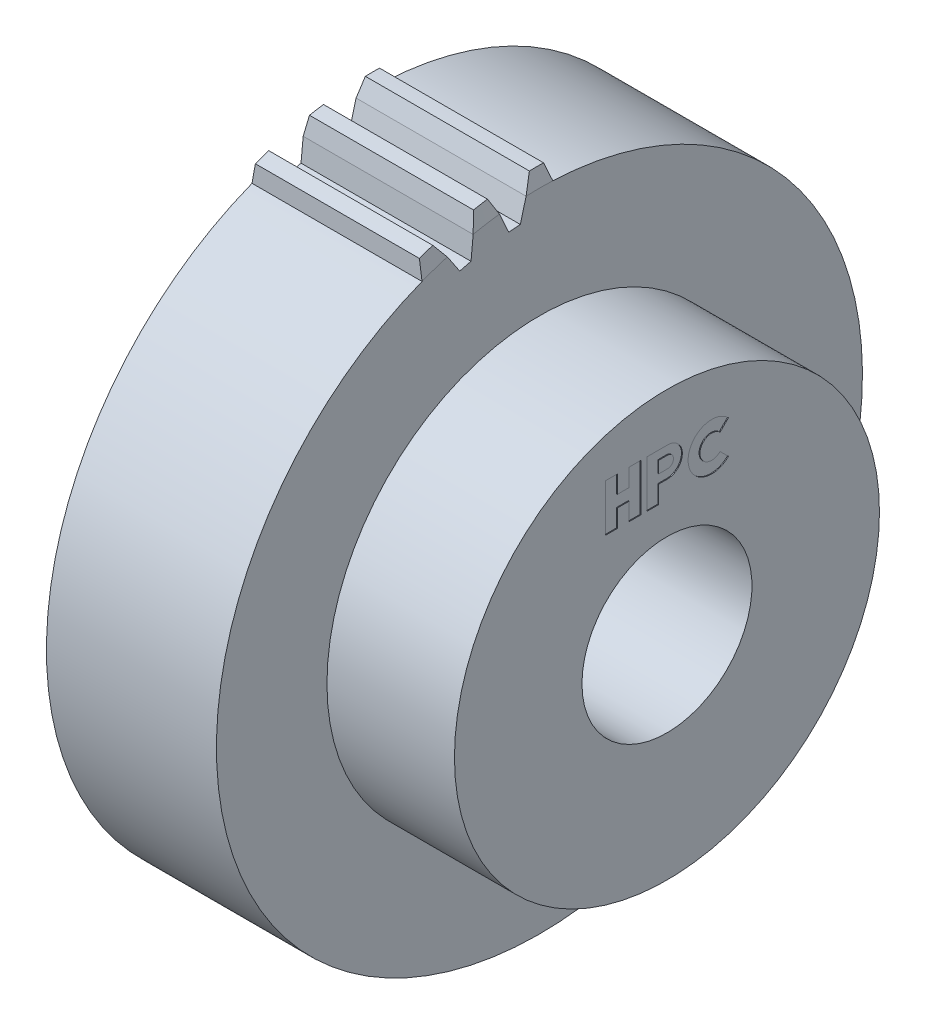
ISO-10303-21;
HEADER;
FILE_DESCRIPTION(('STEP AP214'),'2;1');
FILE_NAME('part.step','',(''),(''),'','','');
FILE_SCHEMA(('AUTOMOTIVE_DESIGN { 1 0 10303 214 1 1 1 1 }'));
ENDSEC;
DATA;
#1=APPLICATION_CONTEXT('core data for automotive mechanical design processes');
#2=APPLICATION_PROTOCOL_DEFINITION('international standard','automotive_design',2000,#1);
#3=PRODUCT_CONTEXT('',#1,'mechanical');
#4=PRODUCT('Part','Part','',(#3));
#5=PRODUCT_RELATED_PRODUCT_CATEGORY('part','',(#4));
#6=PRODUCT_DEFINITION_FORMATION('','',#4);
#7=PRODUCT_DEFINITION_CONTEXT('part definition',#1,'design');
#8=PRODUCT_DEFINITION('design','',#6,#7);
#9=PRODUCT_DEFINITION_SHAPE('','',#8);
#10=(LENGTH_UNIT() NAMED_UNIT(*) SI_UNIT(.MILLI.,.METRE.));
#11=(NAMED_UNIT(*) PLANE_ANGLE_UNIT() SI_UNIT($,.RADIAN.));
#12=(NAMED_UNIT(*) SI_UNIT($,.STERADIAN.) SOLID_ANGLE_UNIT());
#13=UNCERTAINTY_MEASURE_WITH_UNIT(LENGTH_MEASURE(1.E-05),#10,'distance_accuracy_value','');
#14=(GEOMETRIC_REPRESENTATION_CONTEXT(3) GLOBAL_UNCERTAINTY_ASSIGNED_CONTEXT((#13)) GLOBAL_UNIT_ASSIGNED_CONTEXT((#10,
#11,#12)) REPRESENTATION_CONTEXT('',''));
#15=CARTESIAN_POINT('',(0.,0.,0.));
#16=DIRECTION('',(0.,0.,1.));
#17=DIRECTION('',(1.,0.,0.));
#18=AXIS2_PLACEMENT_3D('',#15,#16,#17);
#19=CARTESIAN_POINT('',(35.,18.2638888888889,0.98209275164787));
#20=CARTESIAN_POINT('',(35.,16.875,0.98209275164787));
#21=B_SPLINE_CURVE_WITH_KNOTS('',1,(#19,#20),.UNSPECIFIED.,.F.,.F.,(2,2),(0.,1.),.UNSPECIFIED.);
#22=DIRECTION('',(0.,0.,-1.));
#23=VECTOR('',#22,1.);
#24=SURFACE_OF_LINEAR_EXTRUSION('',#21,#23);
#25=DIRECTION('',(0.,0.,-1.));
#26=VECTOR('',#25,1.);
#27=CARTESIAN_POINT('',(35.,16.875,0.98209275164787));
#28=LINE('',#27,#26);
#29=CARTESIAN_POINT('',(35.,16.875,0.98209275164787));
#30=VERTEX_POINT('',#29);
#31=CARTESIAN_POINT('',(35.,16.875,-0.07378121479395));
#32=VERTEX_POINT('',#31);
#33=EDGE_CURVE('E175',#30,#32,#28,.T.);
#34=ORIENTED_EDGE('',*,*,#33,.T.);
#35=CARTESIAN_POINT('',(35.,17.5694444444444,-0.07378121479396));
#36=DIRECTION('',(1.,0.,0.));
#37=DIRECTION('',(0.,0.,-1.));
#38=AXIS2_PLACEMENT_3D('',#35,#36,#37);
#39=CIRCLE('',#38,0.694444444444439);
#40=CARTESIAN_POINT('',(35.,18.2638888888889,-0.07378121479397));
#41=VERTEX_POINT('',#40);
#42=EDGE_CURVE('E16',#41,#32,#39,.F.);
#43=ORIENTED_EDGE('',*,*,#42,.F.);
#44=DIRECTION('',(0.,0.,-1.));
#45=VECTOR('',#44,1.);
#46=CARTESIAN_POINT('',(35.,18.2638888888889,0.454155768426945));
#47=LINE('',#46,#45);
#48=CARTESIAN_POINT('',(35.,18.2638888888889,0.98209275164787));
#49=VERTEX_POINT('',#48);
#50=EDGE_CURVE('E166',#49,#41,#47,.T.);
#51=ORIENTED_EDGE('',*,*,#50,.F.);
#52=DIRECTION('',(0.,-1.,0.));
#53=VECTOR('',#52,1.);
#54=CARTESIAN_POINT('',(35.,17.5694444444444,0.98209275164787));
#55=LINE('',#54,#53);
#56=EDGE_CURVE('E493',#49,#30,#55,.T.);
#57=ORIENTED_EDGE('',*,*,#56,.T.);
#58=EDGE_LOOP('',(#34,#43,#51,#57));
#59=FACE_BOUND('',#58,.T.);
#60=ADVANCED_FACE('F12',(#59),#24,.T.);
#61=CARTESIAN_POINT('',(35.,18.2638888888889,0.98209275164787));
#62=CARTESIAN_POINT('',(35.,18.2638888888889,-0.07378121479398));
#63=B_SPLINE_CURVE_WITH_KNOTS('',1,(#61,#62),.UNSPECIFIED.,.F.,.F.,(2,2),(0.,1.),.UNSPECIFIED.);
#64=DIRECTION('',(-1.,0.,0.));
#65=VECTOR('',#64,1.);
#66=SURFACE_OF_LINEAR_EXTRUSION('',#63,#65);
#67=ORIENTED_EDGE('',*,*,#50,.T.);
#68=DIRECTION('',(1.,0.,0.));
#69=VECTOR('',#68,1.);
#70=CARTESIAN_POINT('',(34.95,18.2638888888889,-0.0737812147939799));
#71=LINE('',#70,#69);
#72=CARTESIAN_POINT('',(34.9,18.2638888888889,-0.07378121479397));
#73=VERTEX_POINT('',#72);
#74=EDGE_CURVE('E482',#73,#41,#71,.T.);
#75=ORIENTED_EDGE('',*,*,#74,.F.);
#76=DIRECTION('',(0.,0.,-1.));
#77=VECTOR('',#76,1.);
#78=CARTESIAN_POINT('',(34.9,18.2638888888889,0.259640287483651));
#79=LINE('',#78,#77);
#80=CARTESIAN_POINT('',(34.9,18.2638888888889,0.98209275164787));
#81=VERTEX_POINT('',#80);
#82=EDGE_CURVE('E991',#81,#73,#79,.T.);
#83=ORIENTED_EDGE('',*,*,#82,.F.);
#84=DIRECTION('',(-1.,0.,0.));
#85=VECTOR('',#84,1.);
#86=CARTESIAN_POINT('',(35.,18.2638888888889,0.98209275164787));
#87=LINE('',#86,#85);
#88=EDGE_CURVE('E479',#49,#81,#87,.T.);
#89=ORIENTED_EDGE('',*,*,#88,.F.);
#90=EDGE_LOOP('',(#67,#75,#83,#89));
#91=FACE_BOUND('',#90,.T.);
#92=ADVANCED_FACE('F992',(#91),#66,.T.);
#93=CARTESIAN_POINT('',(34.9,17.5694444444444,-0.07378121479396));
#94=DIRECTION('',(1.,0.,0.));
#95=DIRECTION('',(0.,0.,-1.));
#96=AXIS2_PLACEMENT_3D('',#93,#94,#95);
#97=CYLINDRICAL_SURFACE('',#96,0.694444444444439);
#98=ORIENTED_EDGE('',*,*,#42,.T.);
#99=DIRECTION('',(-1.,0.,0.));
#100=VECTOR('',#99,1.);
#101=CARTESIAN_POINT('',(35.,16.875,-0.07378121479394));
#102=LINE('',#101,#100);
#103=CARTESIAN_POINT('',(34.9,16.875,-0.07378121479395));
#104=VERTEX_POINT('',#103);
#105=EDGE_CURVE('E468',#104,#32,#102,.F.);
#106=ORIENTED_EDGE('',*,*,#105,.F.);
#107=CARTESIAN_POINT('',(34.9,17.5694444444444,-0.07378121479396));
#108=DIRECTION('',(1.,0.,0.));
#109=DIRECTION('',(0.,0.,-1.));
#110=AXIS2_PLACEMENT_3D('',#107,#108,#109);
#111=CIRCLE('',#110,0.694444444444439);
#112=EDGE_CURVE('E996',#73,#104,#111,.F.);
#113=ORIENTED_EDGE('',*,*,#112,.F.);
#114=ORIENTED_EDGE('',*,*,#74,.T.);
#115=EDGE_LOOP('',(#98,#106,#113,#114));
#116=FACE_BOUND('',#115,.T.);
#117=ADVANCED_FACE('F1198',(#116),#97,.T.);
#118=CARTESIAN_POINT('',(35.,16.875,-0.07378121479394));
#119=CARTESIAN_POINT('',(35.,16.875,0.98209275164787));
#120=B_SPLINE_CURVE_WITH_KNOTS('',1,(#118,#119),.UNSPECIFIED.,.F.,.F.,(2,2),(0.,1.),.UNSPECIFIED.);
#121=DIRECTION('',(-1.,0.,0.));
#122=VECTOR('',#121,1.);
#123=SURFACE_OF_LINEAR_EXTRUSION('',#120,#122);
#124=ORIENTED_EDGE('',*,*,#33,.F.);
#125=DIRECTION('',(-1.,0.,0.));
#126=VECTOR('',#125,1.);
#127=CARTESIAN_POINT('',(35.,16.875,0.98209275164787));
#128=LINE('',#127,#126);
#129=CARTESIAN_POINT('',(34.9,16.875,0.98209275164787));
#130=VERTEX_POINT('',#129);
#131=EDGE_CURVE('E470',#130,#30,#128,.F.);
#132=ORIENTED_EDGE('',*,*,#131,.F.);
#133=DIRECTION('',(0.,0.,1.));
#134=VECTOR('',#133,1.);
#135=CARTESIAN_POINT('',(34.9,16.875,0.259640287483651));
#136=LINE('',#135,#134);
#137=EDGE_CURVE('E475',#104,#130,#136,.T.);
#138=ORIENTED_EDGE('',*,*,#137,.F.);
#139=ORIENTED_EDGE('',*,*,#105,.T.);
#140=EDGE_LOOP('',(#124,#132,#138,#139));
#141=FACE_BOUND('',#140,.T.);
#142=ADVANCED_FACE('F1194',(#141),#123,.T.);
#143=CARTESIAN_POINT('',(35.,16.875,0.98209275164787));
#144=CARTESIAN_POINT('',(35.,18.2638888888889,0.98209275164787));
#145=B_SPLINE_CURVE_WITH_KNOTS('',1,(#143,#144),.UNSPECIFIED.,.F.,.F.,(2,2),(0.,1.),.UNSPECIFIED.);
#146=DIRECTION('',(-1.,0.,0.));
#147=VECTOR('',#146,1.);
#148=SURFACE_OF_LINEAR_EXTRUSION('',#145,#147);
#149=ORIENTED_EDGE('',*,*,#56,.F.);
#150=ORIENTED_EDGE('',*,*,#88,.T.);
#151=DIRECTION('',(0.,1.,0.));
#152=VECTOR('',#151,1.);
#153=CARTESIAN_POINT('',(34.9,13.75,0.98209275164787));
#154=LINE('',#153,#152);
#155=EDGE_CURVE('E471',#130,#81,#154,.T.);
#156=ORIENTED_EDGE('',*,*,#155,.F.);
#157=ORIENTED_EDGE('',*,*,#131,.T.);
#158=EDGE_LOOP('',(#149,#150,#156,#157));
#159=FACE_BOUND('',#158,.T.);
#160=ADVANCED_FACE('F1000',(#159),#148,.T.);
#161=CARTESIAN_POINT('',(20.,0.,0.));
#162=DIRECTION('',(-1.,0.,0.));
#163=DIRECTION('',(0.,0.,1.));
#164=AXIS2_PLACEMENT_3D('',#161,#162,#163);
#165=CONICAL_SURFACE('',#164,38.,1.39626340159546);
#166=CARTESIAN_POINT('',(19.6473460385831,39.9913004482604,-0.83419929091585));
#167=CARTESIAN_POINT('',(19.7063497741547,39.6540389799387,-0.956952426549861));
#168=CARTESIAN_POINT('',(19.7652455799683,39.3167608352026,-1.07971163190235));
#169=CARTESIAN_POINT('',(19.8534136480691,38.8108165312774,-1.26386029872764));
#170=CARTESIAN_POINT('',(19.8827737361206,38.6421638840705,-1.32524484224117));
#171=CARTESIAN_POINT('',(19.9414330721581,38.3048492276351,-1.44801733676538));
#172=CARTESIAN_POINT('',(19.9707323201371,38.1361872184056,-1.50940528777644));
#173=CARTESIAN_POINT('',(20.,37.9675203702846,-1.57079499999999));
#174=B_SPLINE_CURVE_WITH_KNOTS('',3,(#166,#167,#168,#169,#170,#171,#172,#173),.UNSPECIFIED.,.F.,
.F.,(4,2,2,4),(0.,1.09117166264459,1.63675769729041,2.18234379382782),.UNSPECIFIED.);
#175=CARTESIAN_POINT('',(19.6473460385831,39.9913004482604,-0.83419929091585));
#176=VERTEX_POINT('',#175);
#177=CARTESIAN_POINT('',(20.,37.9675203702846,-1.570795));
#178=VERTEX_POINT('',#177);
#179=EDGE_CURVE('E1077',#176,#178,#174,.T.);
#180=ORIENTED_EDGE('',*,*,#179,.F.);
#181=CARTESIAN_POINT('',(19.6473460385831,0.,0.));
#182=DIRECTION('',(-1.,0.,0.));
#183=DIRECTION('',(0.,1.,0.));
#184=AXIS2_PLACEMENT_3D('',#181,#182,#183);
#185=CIRCLE('',#184,40.);
#186=CARTESIAN_POINT('',(19.6473460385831,39.9913004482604,0.834199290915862));
#187=VERTEX_POINT('',#186);
#188=EDGE_CURVE('E455',#187,#176,#185,.T.);
#189=ORIENTED_EDGE('',*,*,#188,.F.);
#190=CARTESIAN_POINT('',(20.,37.9675203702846,1.57079500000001));
#191=CARTESIAN_POINT('',(19.9707323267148,38.1361871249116,1.50940532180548));
#192=CARTESIAN_POINT('',(19.9414330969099,38.3048490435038,1.44801740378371));
#193=CARTESIAN_POINT('',(19.8681089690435,38.7264922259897,1.29455183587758));
#194=CARTESIAN_POINT('',(19.8240460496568,38.9794676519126,1.20247631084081));
#195=CARTESIAN_POINT('',(19.7357910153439,39.4853986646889,1.01833248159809));
#196=CARTESIAN_POINT('',(19.6915989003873,39.7383542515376,0.926264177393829));
#197=CARTESIAN_POINT('',(19.6473460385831,39.9913004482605,0.83419929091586));
#198=B_SPLINE_CURVE_WITH_KNOTS('',3,(#190,#191,#192,#193,#194,#195,#196,#197),.UNSPECIFIED.,.F.,
.F.,(4,2,2,4),(0.,0.545585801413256,1.36396470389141,2.1823437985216),.UNSPECIFIED.);
#199=CARTESIAN_POINT('',(20.,37.9675203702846,1.57079500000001));
#200=VERTEX_POINT('',#199);
#201=EDGE_CURVE('E467',#200,#187,#198,.T.);
#202=ORIENTED_EDGE('',*,*,#201,.F.);
#203=CARTESIAN_POINT('',(20.,0.,0.));
#204=DIRECTION('',(-1.,0.,0.));
#205=DIRECTION('',(0.,0.,1.));
#206=AXIS2_PLACEMENT_3D('',#203,#204,#205);
#207=CIRCLE('',#206,38.);
#208=EDGE_CURVE('E487',#200,#178,#207,.T.);
#209=ORIENTED_EDGE('',*,*,#208,.T.);
#210=EDGE_LOOP('',(#180,#189,#202,#209));
#211=FACE_BOUND('',#210,.T.);
#212=ADVANCED_FACE('F1065',(#211),#165,.T.);
#213=CARTESIAN_POINT('',(0.,0.,0.));
#214=DIRECTION('',(1.,0.,0.));
#215=DIRECTION('',(0.,0.,-1.));
#216=AXIS2_PLACEMENT_3D('',#213,#214,#215);
#217=CONICAL_SURFACE('',#216,38.,1.39626340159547);
#218=CARTESIAN_POINT('',(0.,37.9675203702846,-1.57079499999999));
#219=CARTESIAN_POINT('',(0.0292676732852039,38.1361871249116,-1.50940532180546));
#220=CARTESIAN_POINT('',(0.0585669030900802,38.3048490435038,-1.44801740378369));
#221=CARTESIAN_POINT('',(0.131891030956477,38.7264922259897,-1.29455183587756));
#222=CARTESIAN_POINT('',(0.175953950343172,38.9794676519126,-1.20247631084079));
#223=CARTESIAN_POINT('',(0.264208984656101,39.4853986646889,-1.01833248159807));
#224=CARTESIAN_POINT('',(0.308401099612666,39.7383542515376,-0.926264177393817));
#225=CARTESIAN_POINT('',(0.352653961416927,39.9913004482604,-0.83419929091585));
#226=B_SPLINE_CURVE_WITH_KNOTS('',3,(#218,#219,#220,#221,#222,#223,#224,#225),.UNSPECIFIED.,.F.,
.F.,(4,2,2,4),(0.,0.545585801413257,1.36396470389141,2.18234379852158),.UNSPECIFIED.);
#227=CARTESIAN_POINT('',(0.,37.9675203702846,-1.57079499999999));
#228=VERTEX_POINT('',#227);
#229=CARTESIAN_POINT('',(0.352653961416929,39.9913004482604,-0.83419929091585));
#230=VERTEX_POINT('',#229);
#231=EDGE_CURVE('E453',#228,#230,#226,.T.);
#232=ORIENTED_EDGE('',*,*,#231,.F.);
#233=CARTESIAN_POINT('',(0.,0.,0.));
#234=DIRECTION('',(1.,0.,0.));
#235=DIRECTION('',(0.,0.,-1.));
#236=AXIS2_PLACEMENT_3D('',#233,#234,#235);
#237=CIRCLE('',#236,38.);
#238=CARTESIAN_POINT('',(0.,37.9675203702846,1.57079500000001));
#239=VERTEX_POINT('',#238);
#240=EDGE_CURVE('E460',#228,#239,#237,.T.);
#241=ORIENTED_EDGE('',*,*,#240,.T.);
#242=CARTESIAN_POINT('',(0.352653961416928,39.9913004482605,0.83419929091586));
#243=CARTESIAN_POINT('',(0.2936502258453,39.6540389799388,0.956952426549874));
#244=CARTESIAN_POINT('',(0.234754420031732,39.3167608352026,1.07971163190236));
#245=CARTESIAN_POINT('',(0.14658635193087,38.8108165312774,1.26386029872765));
#246=CARTESIAN_POINT('',(0.117226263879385,38.6421638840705,1.32524484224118));
#247=CARTESIAN_POINT('',(0.0585669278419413,38.3048492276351,1.44801733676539));
#248=CARTESIAN_POINT('',(0.0292676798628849,38.1361872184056,1.50940528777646));
#249=CARTESIAN_POINT('',(0.,37.9675203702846,1.57079500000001));
#250=B_SPLINE_CURVE_WITH_KNOTS('',3,(#242,#243,#244,#245,#246,#247,#248,#249),.UNSPECIFIED.,.F.,
.F.,(4,2,2,4),(0.,1.0911716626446,1.63675769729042,2.18234379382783),.UNSPECIFIED.);
#251=CARTESIAN_POINT('',(0.352653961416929,39.9913004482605,0.83419929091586));
#252=VERTEX_POINT('',#251);
#253=EDGE_CURVE('E1052',#252,#239,#250,.T.);
#254=ORIENTED_EDGE('',*,*,#253,.F.);
#255=CARTESIAN_POINT('',(0.35265396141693,0.,0.));
#256=DIRECTION('',(-1.,0.,0.));
#257=DIRECTION('',(0.,1.,0.));
#258=AXIS2_PLACEMENT_3D('',#255,#256,#257);
#259=CIRCLE('',#258,40.);
#260=EDGE_CURVE('E449',#230,#252,#259,.F.);
#261=ORIENTED_EDGE('',*,*,#260,.F.);
#262=EDGE_LOOP('',(#232,#241,#254,#261));
#263=FACE_BOUND('',#262,.T.);
#264=ADVANCED_FACE('F1059',(#263),#217,.T.);
#265=CARTESIAN_POINT('',(0.35265396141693,0.,0.));
#266=DIRECTION('',(1.,0.,0.));
#267=DIRECTION('',(0.,0.,-1.));
#268=AXIS2_PLACEMENT_3D('',#265,#266,#267);
#269=CYLINDRICAL_SURFACE('',#268,40.);
#270=DIRECTION('',(1.,0.,0.));
#271=VECTOR('',#270,1.);
#272=CARTESIAN_POINT('',(0.,39.9913004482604,-0.83419929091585));
#273=LINE('',#272,#271);
#274=EDGE_CURVE('E450',#230,#176,#273,.T.);
#275=ORIENTED_EDGE('',*,*,#274,.F.);
#276=ORIENTED_EDGE('',*,*,#260,.T.);
#277=DIRECTION('',(1.,0.,0.));
#278=VECTOR('',#277,1.);
#279=CARTESIAN_POINT('',(0.,39.9913004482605,0.83419929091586));
#280=LINE('',#279,#278);
#281=EDGE_CURVE('E463',#187,#252,#280,.F.);
#282=ORIENTED_EDGE('',*,*,#281,.F.);
#283=ORIENTED_EDGE('',*,*,#188,.T.);
#284=EDGE_LOOP('',(#275,#276,#282,#283));
#285=FACE_BOUND('',#284,.T.);
#286=ADVANCED_FACE('F1064',(#285),#269,.T.);
#287=CARTESIAN_POINT('',(0.35265396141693,0.,0.));
#288=DIRECTION('',(1.,0.,0.));
#289=DIRECTION('',(0.,0.,-1.));
#290=AXIS2_PLACEMENT_3D('',#287,#288,#289);
#291=CYLINDRICAL_SURFACE('',#290,40.);
#292=DIRECTION('',(1.,0.,0.));
#293=VECTOR('',#292,1.);
#294=CARTESIAN_POINT('',(0.,38.0953255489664,12.1961539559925));
#295=LINE('',#294,#293);
#296=CARTESIAN_POINT('',(0.352653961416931,38.0953255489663,12.1961539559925));
#297=VERTEX_POINT('',#296);
#298=CARTESIAN_POINT('',(19.6473460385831,38.0953255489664,12.1961539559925));
#299=VERTEX_POINT('',#298);
#300=EDGE_CURVE('E408',#297,#299,#295,.T.);
#301=ORIENTED_EDGE('',*,*,#300,.F.);
#302=CARTESIAN_POINT('',(0.35265396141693,0.,0.));
#303=DIRECTION('',(-1.,0.,0.));
#304=DIRECTION('',(0.,1.,0.));
#305=AXIS2_PLACEMENT_3D('',#302,#303,#304);
#306=CIRCLE('',#305,40.);
#307=CARTESIAN_POINT('',(0.352653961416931,37.5535974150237,13.7741541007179));
#308=VERTEX_POINT('',#307);
#309=EDGE_CURVE('E447',#297,#308,#306,.F.);
#310=ORIENTED_EDGE('',*,*,#309,.T.);
#311=DIRECTION('',(1.,0.,0.));
#312=VECTOR('',#311,1.);
#313=CARTESIAN_POINT('',(0.,37.5535974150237,13.7741541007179));
#314=LINE('',#313,#312);
#315=CARTESIAN_POINT('',(19.6473460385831,37.5535974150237,13.7741541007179));
#316=VERTEX_POINT('',#315);
#317=EDGE_CURVE('E412',#316,#308,#314,.F.);
#318=ORIENTED_EDGE('',*,*,#317,.F.);
#319=CARTESIAN_POINT('',(19.6473460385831,0.,0.));
#320=DIRECTION('',(1.,0.,0.));
#321=DIRECTION('',(0.,1.,0.));
#322=AXIS2_PLACEMENT_3D('',#319,#320,#321);
#323=CIRCLE('',#322,40.);
#324=EDGE_CURVE('E443',#299,#316,#323,.T.);
#325=ORIENTED_EDGE('',*,*,#324,.F.);
#326=EDGE_LOOP('',(#301,#310,#318,#325));
#327=FACE_BOUND('',#326,.T.);
#328=ADVANCED_FACE('F1141',(#327),#291,.T.);
#329=CARTESIAN_POINT('',(20.,0.,0.));
#330=DIRECTION('',(-1.,0.,0.));
#331=DIRECTION('',(0.,0.,1.));
#332=AXIS2_PLACEMENT_3D('',#329,#330,#331);
#333=CONICAL_SURFACE('',#332,38.,1.39626340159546);
#334=CARTESIAN_POINT('',(19.6473460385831,38.0953255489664,12.1961539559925));
#335=CARTESIAN_POINT('',(19.7063497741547,37.81619571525,11.9705433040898));
#336=CARTESIAN_POINT('',(19.7652455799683,37.5370520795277,11.7449214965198));
#337=CARTESIAN_POINT('',(19.8534136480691,37.118314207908,11.4064706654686));
#338=CARTESIAN_POINT('',(19.8827737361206,36.9787311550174,11.2936506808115));
#339=CARTESIAN_POINT('',(19.9414330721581,36.6995573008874,11.0680044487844));
#340=CARTESIAN_POINT('',(19.9707323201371,36.5599664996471,10.9551782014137));
#341=CARTESIAN_POINT('',(20.,36.4203716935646,10.8423487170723));
#342=B_SPLINE_CURVE_WITH_KNOTS('',3,(#334,#335,#336,#337,#338,#339,#340,#341),.UNSPECIFIED.,.F.,
.F.,(4,2,2,4),(0.,1.0911716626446,1.63675769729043,2.18234379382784),.UNSPECIFIED.);
#343=CARTESIAN_POINT('',(20.,36.4203716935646,10.8423487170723));
#344=VERTEX_POINT('',#343);
#345=EDGE_CURVE('E411',#299,#344,#342,.T.);
#346=ORIENTED_EDGE('',*,*,#345,.F.);
#347=ORIENTED_EDGE('',*,*,#324,.T.);
#348=CARTESIAN_POINT('',(20.,35.4002990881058,13.8137187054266));
#349=CARTESIAN_POINT('',(19.9707323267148,35.5797602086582,13.8104212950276));
#350=CARTESIAN_POINT('',(19.9414330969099,35.7592161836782,13.8071239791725));
#351=CARTESIAN_POINT('',(19.8681089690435,36.2078437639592,13.7988809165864));
#352=CARTESIAN_POINT('',(19.8240460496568,36.4770091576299,13.793935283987));
#353=CARTESIAN_POINT('',(19.7357910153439,37.0153188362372,13.7840444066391));
#354=CARTESIAN_POINT('',(19.6915989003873,37.2844631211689,13.7790991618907));
#355=CARTESIAN_POINT('',(19.6473460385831,37.5535974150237,13.7741541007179));
#356=B_SPLINE_CURVE_WITH_KNOTS('',3,(#348,#349,#350,#351,#352,#353,#354,#355),.UNSPECIFIED.,.F.,
.F.,(4,2,2,4),(0.,0.545585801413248,1.36396470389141,2.18234379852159),.UNSPECIFIED.);
#357=CARTESIAN_POINT('',(20.,35.4002990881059,13.8137187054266));
#358=VERTEX_POINT('',#357);
#359=EDGE_CURVE('E415',#358,#316,#356,.T.);
#360=ORIENTED_EDGE('',*,*,#359,.F.);
#361=CARTESIAN_POINT('',(20.,0.,0.));
#362=DIRECTION('',(-1.,0.,0.));
#363=DIRECTION('',(0.,0.,1.));
#364=AXIS2_PLACEMENT_3D('',#361,#362,#363);
#365=CIRCLE('',#364,38.);
#366=EDGE_CURVE('E1128',#344,#358,#365,.F.);
#367=ORIENTED_EDGE('',*,*,#366,.F.);
#368=EDGE_LOOP('',(#346,#347,#360,#367));
#369=FACE_BOUND('',#368,.T.);
#370=ADVANCED_FACE('F1137',(#369),#333,.T.);
#371=CARTESIAN_POINT('',(20.,0.,0.));
#372=DIRECTION('',(-1.,0.,0.));
#373=DIRECTION('',(0.,0.,1.));
#374=AXIS2_PLACEMENT_3D('',#371,#372,#373);
#375=CONICAL_SURFACE('',#374,38.,1.39626340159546);
#376=CARTESIAN_POINT('',(20.,37.1911485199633,7.79861986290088));
#377=CARTESIAN_POINT('',(19.9707323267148,37.3676192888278,7.76582909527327));
#378=CARTESIAN_POINT('',(19.9414330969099,37.5440849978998,7.73303926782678));
#379=CARTESIAN_POINT('',(19.8681089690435,37.9852371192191,7.65106695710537));
#380=CARTESIAN_POINT('',(19.8240460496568,38.2499174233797,7.6018856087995));
#381=CARTESIAN_POINT('',(19.7357910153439,38.7792572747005,7.50352676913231));
#382=CARTESIAN_POINT('',(19.6915989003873,39.0439168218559,7.4543492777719));
#383=CARTESIAN_POINT('',(19.647346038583,39.3085665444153,7.40517361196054));
#384=B_SPLINE_CURVE_WITH_KNOTS('',3,(#376,#377,#378,#379,#380,#381,#382,#383),.UNSPECIFIED.,.F.,
.F.,(4,2,2,4),(0.,0.545585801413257,1.36396470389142,2.18234379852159),.UNSPECIFIED.);
#385=CARTESIAN_POINT('',(20.,37.1911485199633,7.79861986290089));
#386=VERTEX_POINT('',#385);
#387=CARTESIAN_POINT('',(19.6473460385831,39.3085665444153,7.40517361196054));
#388=VERTEX_POINT('',#387);
#389=EDGE_CURVE('E397',#386,#388,#384,.T.);
#390=ORIENTED_EDGE('',*,*,#389,.F.);
#391=CARTESIAN_POINT('',(20.,0.,0.));
#392=DIRECTION('',(-1.,0.,0.));
#393=DIRECTION('',(0.,0.,1.));
#394=AXIS2_PLACEMENT_3D('',#391,#392,#393);
#395=CIRCLE('',#394,38.);
#396=CARTESIAN_POINT('',(20.,37.7082372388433,4.69987705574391));
#397=VERTEX_POINT('',#396);
#398=EDGE_CURVE('E1131',#397,#386,#395,.F.);
#399=ORIENTED_EDGE('',*,*,#398,.F.);
#400=CARTESIAN_POINT('',(19.6473460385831,39.5831759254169,5.75952981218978));
#401=CARTESIAN_POINT('',(19.7063497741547,39.2707187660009,5.58293945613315));
#402=CARTESIAN_POINT('',(19.7652455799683,38.9582461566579,5.4063403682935));
#403=CARTESIAN_POINT('',(19.8534136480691,38.4895121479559,5.14142755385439));
#404=CARTESIAN_POINT('',(19.8827737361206,38.3332632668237,5.05312090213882));
#405=CARTESIAN_POINT('',(19.941433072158,38.0207568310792,4.87650269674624));
#406=CARTESIAN_POINT('',(19.9707323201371,37.8644992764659,4.78819114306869));
#407=CARTESIAN_POINT('',(20.,37.7082372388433,4.69987705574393));
#408=B_SPLINE_CURVE_WITH_KNOTS('',3,(#400,#401,#402,#403,#404,#405,#406,#407),.UNSPECIFIED.,.F.,
.F.,(4,2,2,4),(0.,1.09117166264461,1.63675769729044,2.18234379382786),.UNSPECIFIED.);
#409=CARTESIAN_POINT('',(19.6473460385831,39.5831759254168,5.75952981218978));
#410=VERTEX_POINT('',#409);
#411=EDGE_CURVE('E401',#410,#397,#408,.T.);
#412=ORIENTED_EDGE('',*,*,#411,.F.);
#413=CARTESIAN_POINT('',(19.6473460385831,0.,0.));
#414=DIRECTION('',(-1.,0.,0.));
#415=DIRECTION('',(0.,1.,0.));
#416=AXIS2_PLACEMENT_3D('',#413,#414,#415);
#417=CIRCLE('',#416,40.);
#418=EDGE_CURVE('E442',#388,#410,#417,.T.);
#419=ORIENTED_EDGE('',*,*,#418,.F.);
#420=EDGE_LOOP('',(#390,#399,#412,#419));
#421=FACE_BOUND('',#420,.T.);
#422=ADVANCED_FACE('F1140',(#421),#375,.T.);
#423=CARTESIAN_POINT('',(0.35265396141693,0.,0.));
#424=DIRECTION('',(1.,0.,0.));
#425=DIRECTION('',(0.,0.,-1.));
#426=AXIS2_PLACEMENT_3D('',#423,#424,#425);
#427=CYLINDRICAL_SURFACE('',#426,40.);
#428=DIRECTION('',(1.,0.,0.));
#429=VECTOR('',#428,1.);
#430=CARTESIAN_POINT('',(0.,39.3085665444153,7.40517361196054));
#431=LINE('',#430,#429);
#432=CARTESIAN_POINT('',(0.352653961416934,39.3085665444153,7.40517361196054));
#433=VERTEX_POINT('',#432);
#434=EDGE_CURVE('E394',#388,#433,#431,.F.);
#435=ORIENTED_EDGE('',*,*,#434,.F.);
#436=ORIENTED_EDGE('',*,*,#418,.T.);
#437=DIRECTION('',(1.,0.,0.));
#438=VECTOR('',#437,1.);
#439=CARTESIAN_POINT('',(0.,39.5831759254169,5.75952981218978));
#440=LINE('',#439,#438);
#441=CARTESIAN_POINT('',(0.352653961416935,39.5831759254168,5.75952981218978));
#442=VERTEX_POINT('',#441);
#443=EDGE_CURVE('E398',#442,#410,#440,.T.);
#444=ORIENTED_EDGE('',*,*,#443,.F.);
#445=CARTESIAN_POINT('',(0.35265396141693,0.,0.));
#446=DIRECTION('',(-1.,0.,0.));
#447=DIRECTION('',(0.,1.,0.));
#448=AXIS2_PLACEMENT_3D('',#445,#446,#447);
#449=CIRCLE('',#448,40.);
#450=EDGE_CURVE('E440',#442,#433,#449,.F.);
#451=ORIENTED_EDGE('',*,*,#450,.T.);
#452=EDGE_LOOP('',(#435,#436,#444,#451));
#453=FACE_BOUND('',#452,.T.);
#454=ADVANCED_FACE('F1147',(#453),#427,.T.);
#455=CARTESIAN_POINT('',(34.9,13.75,-2.43974624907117));
#456=CARTESIAN_POINT('',(34.9,13.75,-2.48716588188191));
#457=CARTESIAN_POINT('',(34.9,13.75,-7.22912916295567));
#458=B_SPLINE_CURVE_WITH_KNOTS('',1,(#455,#456,#457),.UNSPECIFIED.,.F.,.F.,(2,1,2),(-0.01,0.,
1.),.UNSPECIFIED.);
#459=DIRECTION('',(0.,1.,0.));
#460=VECTOR('',#459,1.);
#461=SURFACE_OF_LINEAR_EXTRUSION('',#458,#460);
#462=CARTESIAN_POINT('',(34.9,16.5277777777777,-5.26494365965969));
#463=DIRECTION('',(-1.,0.,0.));
#464=DIRECTION('',(0.,0.,1.));
#465=AXIS2_PLACEMENT_3D('',#462,#463,#464);
#466=CIRCLE('',#465,2.77777777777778);
#467=CARTESIAN_POINT('',(34.9,14.5635922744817,-7.22912916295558));
#468=VERTEX_POINT('',#467);
#469=CARTESIAN_POINT('',(34.9,18.4919632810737,-7.22912916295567));
#470=VERTEX_POINT('',#469);
#471=EDGE_CURVE('E221',#468,#470,#466,.T.);
#472=ORIENTED_EDGE('',*,*,#471,.F.);
#473=DIRECTION('',(0.,-0.707106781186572,-0.707106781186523));
#474=VECTOR('',#473,1.);
#475=CARTESIAN_POINT('',(34.9,15.0546386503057,-6.73808278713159));
#476=LINE('',#475,#474);
#477=CARTESIAN_POINT('',(34.9,15.5456850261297,-6.2470364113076));
#478=VERTEX_POINT('',#477);
#479=EDGE_CURVE('E220',#478,#468,#476,.T.);
#480=ORIENTED_EDGE('',*,*,#479,.F.);
#481=CARTESIAN_POINT('',(34.9,16.5277777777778,-5.26494365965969));
#482=DIRECTION('',(1.,0.,0.));
#483=DIRECTION('',(0.,0.,-1.));
#484=AXIS2_PLACEMENT_3D('',#481,#482,#483);
#485=CIRCLE('',#484,1.38888888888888);
#486=CARTESIAN_POINT('',(34.9,17.5098705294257,-6.24703641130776));
#487=VERTEX_POINT('',#486);
#488=EDGE_CURVE('E388',#487,#478,#485,.T.);
#489=ORIENTED_EDGE('',*,*,#488,.F.);
#490=DIRECTION('',(0.,-0.707106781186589,0.707106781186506));
#491=VECTOR('',#490,1.);
#492=CARTESIAN_POINT('',(34.9,18.0009169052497,-6.73808278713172));
#493=LINE('',#492,#491);
#494=EDGE_CURVE('E392',#470,#487,#493,.T.);
#495=ORIENTED_EDGE('',*,*,#494,.F.);
#496=EDGE_LOOP('',(#472,#480,#489,#495));
#497=FACE_BOUND('',#496,.T.);
#498=ADVANCED_FACE('F1166',(#497),#461,.T.);
#499=CARTESIAN_POINT('',(34.9,13.75,2.37098164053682));
#500=CARTESIAN_POINT('',(34.9,13.75,-1.8098923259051));
#501=CARTESIAN_POINT('',(34.9,13.75,-1.85170106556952));
#502=B_SPLINE_CURVE_WITH_KNOTS('',1,(#499,#500,#501),.UNSPECIFIED.,.F.,.F.,(2,1,2),(0.,1.,1.01),.UNSPECIFIED.);
#503=DIRECTION('',(0.,1.,0.));
#504=VECTOR('',#503,1.);
#505=SURFACE_OF_LINEAR_EXTRUSION('',#502,#504);
#506=ORIENTED_EDGE('',*,*,#137,.T.);
#507=ORIENTED_EDGE('',*,*,#155,.T.);
#508=ORIENTED_EDGE('',*,*,#82,.T.);
#509=ORIENTED_EDGE('',*,*,#112,.T.);
#510=EDGE_LOOP('',(#506,#507,#508,#509));
#511=FACE_BOUND('',#510,.T.);
#512=DIRECTION('',(0.,1.,0.));
#513=VECTOR('',#512,1.);
#514=CARTESIAN_POINT('',(34.9,16.5277777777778,2.37098164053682));
#515=LINE('',#514,#513);
#516=CARTESIAN_POINT('',(34.9,13.75,2.37098164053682));
#517=VERTEX_POINT('',#516);
#518=CARTESIAN_POINT('',(34.9,19.3055555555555,2.37098164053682));
#519=VERTEX_POINT('',#518);
#520=EDGE_CURVE('E372',#517,#519,#515,.T.);
#521=ORIENTED_EDGE('',*,*,#520,.F.);
#522=DIRECTION('',(0.,0.,1.));
#523=VECTOR('',#522,1.);
#524=CARTESIAN_POINT('',(34.9,13.75,1.67653719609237));
#525=LINE('',#524,#523);
#526=CARTESIAN_POINT('',(34.9,13.75,0.98209275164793));
#527=VERTEX_POINT('',#526);
#528=EDGE_CURVE('E382',#527,#517,#525,.T.);
#529=ORIENTED_EDGE('',*,*,#528,.F.);
#530=DIRECTION('',(0.,-1.,0.));
#531=VECTOR('',#530,1.);
#532=CARTESIAN_POINT('',(34.9,14.7916666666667,0.9820927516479));
#533=LINE('',#532,#531);
#534=CARTESIAN_POINT('',(34.9,15.8333333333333,0.98209275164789));
#535=VERTEX_POINT('',#534);
#536=EDGE_CURVE('E387',#535,#527,#533,.T.);
#537=ORIENTED_EDGE('',*,*,#536,.F.);
#538=DIRECTION('',(0.,0.,-1.));
#539=VECTOR('',#538,1.);
#540=CARTESIAN_POINT('',(34.9,15.8333333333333,0.259640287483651));
#541=LINE('',#540,#539);
#542=CARTESIAN_POINT('',(34.9,15.8333333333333,-0.073781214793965));
#543=VERTEX_POINT('',#542);
#544=EDGE_CURVE('E445',#535,#543,#541,.T.);
#545=ORIENTED_EDGE('',*,*,#544,.T.);
#546=CARTESIAN_POINT('',(34.9,17.5694444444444,-0.07378121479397));
#547=DIRECTION('',(-1.,0.,0.));
#548=DIRECTION('',(0.,0.,1.));
#549=AXIS2_PLACEMENT_3D('',#546,#547,#548);
#550=CIRCLE('',#549,1.73611111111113);
#551=CARTESIAN_POINT('',(34.9,19.3055555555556,-0.0737812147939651));
#552=VERTEX_POINT('',#551);
#553=EDGE_CURVE('E356',#552,#543,#550,.T.);
#554=ORIENTED_EDGE('',*,*,#553,.F.);
#555=DIRECTION('',(0.,0.,-1.));
#556=VECTOR('',#555,1.);
#557=CARTESIAN_POINT('',(34.9,19.3055555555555,1.14860021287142));
#558=LINE('',#557,#556);
#559=EDGE_CURVE('E360',#519,#552,#558,.T.);
#560=ORIENTED_EDGE('',*,*,#559,.F.);
#561=EDGE_LOOP('',(#521,#529,#537,#545,#554,#560));
#562=FACE_BOUND('',#561,.T.);
#563=ADVANCED_FACE('F1002',(#511,#562),#505,.T.);
#564=CARTESIAN_POINT('',(34.9,13.75,7.22912916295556));
#565=CARTESIAN_POINT('',(34.9,13.75,3.06246249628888));
#566=B_SPLINE_CURVE_WITH_KNOTS('',1,(#564,#565),.UNSPECIFIED.,.F.,.F.,(2,2),(0.,1.),.UNSPECIFIED.);
#567=DIRECTION('',(0.,1.,0.));
#568=VECTOR('',#567,1.);
#569=SURFACE_OF_LINEAR_EXTRUSION('',#566,#568);
#570=DIRECTION('',(0.,1.,0.));
#571=VECTOR('',#570,1.);
#572=CARTESIAN_POINT('',(34.9,16.5277777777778,7.22912916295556));
#573=LINE('',#572,#571);
#574=CARTESIAN_POINT('',(34.9,13.75,7.22912916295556));
#575=VERTEX_POINT('',#574);
#576=CARTESIAN_POINT('',(34.9,19.3055555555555,7.22912916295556));
#577=VERTEX_POINT('',#576);
#578=EDGE_CURVE('E665',#575,#577,#573,.T.);
#579=ORIENTED_EDGE('',*,*,#578,.F.);
#580=DIRECTION('',(0.,0.,1.));
#581=VECTOR('',#580,1.);
#582=CARTESIAN_POINT('',(34.9,13.75,6.53468471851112));
#583=LINE('',#582,#581);
#584=CARTESIAN_POINT('',(34.9,13.75,5.84024027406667));
#585=VERTEX_POINT('',#584);
#586=EDGE_CURVE('E632',#585,#575,#583,.T.);
#587=ORIENTED_EDGE('',*,*,#586,.F.);
#588=DIRECTION('',(0.,-1.,0.));
#589=VECTOR('',#588,1.);
#590=CARTESIAN_POINT('',(34.9,14.7916666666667,5.84024027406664));
#591=LINE('',#590,#589);
#592=CARTESIAN_POINT('',(34.9,15.8333333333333,5.84024027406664));
#593=VERTEX_POINT('',#592);
#594=EDGE_CURVE('E341',#593,#585,#591,.T.);
#595=ORIENTED_EDGE('',*,*,#594,.F.);
#596=DIRECTION('',(0.,0.,-1.));
#597=VECTOR('',#596,1.);
#598=CARTESIAN_POINT('',(34.9,15.8333333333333,5.14579582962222));
#599=LINE('',#598,#597);
#600=CARTESIAN_POINT('',(34.9,15.8333333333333,4.45135138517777));
#601=VERTEX_POINT('',#600);
#602=EDGE_CURVE('E474',#593,#601,#599,.T.);
#603=ORIENTED_EDGE('',*,*,#602,.T.);
#604=DIRECTION('',(0.,1.,0.));
#605=VECTOR('',#604,1.);
#606=CARTESIAN_POINT('',(34.9,14.7916666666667,4.45135138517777));
#607=LINE('',#606,#605);
#608=CARTESIAN_POINT('',(34.9,13.75,4.45135138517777));
#609=VERTEX_POINT('',#608);
#610=EDGE_CURVE('E771',#609,#601,#607,.T.);
#611=ORIENTED_EDGE('',*,*,#610,.F.);
#612=DIRECTION('',(0.,0.,1.));
#613=VECTOR('',#612,1.);
#614=CARTESIAN_POINT('',(34.9,13.75,3.75690694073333));
#615=LINE('',#614,#613);
#616=CARTESIAN_POINT('',(34.9,13.75,3.06246249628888));
#617=VERTEX_POINT('',#616);
#618=EDGE_CURVE('E758',#617,#609,#615,.T.);
#619=ORIENTED_EDGE('',*,*,#618,.F.);
#620=DIRECTION('',(0.,-1.,0.));
#621=VECTOR('',#620,1.);
#622=CARTESIAN_POINT('',(34.9,16.5277777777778,3.06246249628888));
#623=LINE('',#622,#621);
#624=CARTESIAN_POINT('',(34.9,19.3055555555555,3.06246249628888));
#625=VERTEX_POINT('',#624);
#626=EDGE_CURVE('E759',#625,#617,#623,.T.);
#627=ORIENTED_EDGE('',*,*,#626,.F.);
#628=DIRECTION('',(0.,0.,-1.));
#629=VECTOR('',#628,1.);
#630=CARTESIAN_POINT('',(34.9,19.3055555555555,3.75690694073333));
#631=LINE('',#630,#629);
#632=CARTESIAN_POINT('',(34.9,19.3055555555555,4.45135138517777));
#633=VERTEX_POINT('',#632);
#634=EDGE_CURVE('E724',#633,#625,#631,.T.);
#635=ORIENTED_EDGE('',*,*,#634,.F.);
#636=DIRECTION('',(0.,1.,0.));
#637=VECTOR('',#636,1.);
#638=CARTESIAN_POINT('',(34.9,18.2638888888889,4.45135138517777));
#639=LINE('',#638,#637);
#640=CARTESIAN_POINT('',(34.9,17.2222222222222,4.45135138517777));
#641=VERTEX_POINT('',#640);
#642=EDGE_CURVE('E711',#641,#633,#639,.T.);
#643=ORIENTED_EDGE('',*,*,#642,.F.);
#644=DIRECTION('',(0.,0.,-1.));
#645=VECTOR('',#644,1.);
#646=CARTESIAN_POINT('',(34.9,17.2222222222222,5.14579582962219));
#647=LINE('',#646,#645);
#648=CARTESIAN_POINT('',(34.9,17.2222222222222,5.84024027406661));
#649=VERTEX_POINT('',#648);
#650=EDGE_CURVE('E712',#649,#641,#647,.T.);
#651=ORIENTED_EDGE('',*,*,#650,.F.);
#652=DIRECTION('',(0.,-1.,0.));
#653=VECTOR('',#652,1.);
#654=CARTESIAN_POINT('',(34.9,18.2638888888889,5.84024027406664));
#655=LINE('',#654,#653);
#656=CARTESIAN_POINT('',(34.9,19.3055555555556,5.84024027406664));
#657=VERTEX_POINT('',#656);
#658=EDGE_CURVE('E677',#657,#649,#655,.T.);
#659=ORIENTED_EDGE('',*,*,#658,.F.);
#660=DIRECTION('',(0.,0.,-1.));
#661=VECTOR('',#660,1.);
#662=CARTESIAN_POINT('',(34.9,19.3055555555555,6.53468471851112));
#663=LINE('',#662,#661);
#664=EDGE_CURVE('E664',#577,#657,#663,.T.);
#665=ORIENTED_EDGE('',*,*,#664,.F.);
#666=EDGE_LOOP('',(#579,#587,#595,#603,#611,#619,#627,#635,#643,#651,#659,#665));
#667=FACE_BOUND('',#666,.T.);
#668=ADVANCED_FACE('F1028',(#667),#569,.T.);
#669=CARTESIAN_POINT('',(0.,39.9913004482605,0.83419929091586));
#670=CARTESIAN_POINT('',(0.,37.9675203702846,1.57079500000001));
#671=B_SPLINE_CURVE_WITH_KNOTS('',1,(#669,#670),.UNSPECIFIED.,.F.,.F.,(2,2),(0.,1.),.UNSPECIFIED.);
#672=DIRECTION('',(1.,0.,0.));
#673=VECTOR('',#672,1.);
#674=SURFACE_OF_LINEAR_EXTRUSION('',#671,#673);
#675=ORIENTED_EDGE('',*,*,#201,.T.);
#676=ORIENTED_EDGE('',*,*,#281,.T.);
#677=ORIENTED_EDGE('',*,*,#253,.T.);
#678=DIRECTION('',(1.,0.,0.));
#679=VECTOR('',#678,1.);
#680=CARTESIAN_POINT('',(0.,37.9675203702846,1.570795));
#681=LINE('',#680,#679);
#682=EDGE_CURVE('E327',#200,#239,#681,.F.);
#683=ORIENTED_EDGE('',*,*,#682,.F.);
#684=EDGE_LOOP('',(#675,#676,#677,#683));
#685=FACE_BOUND('',#684,.T.);
#686=ADVANCED_FACE('F1031',(#685),#674,.T.);
#687=CARTESIAN_POINT('',(20.,1.32185928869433E-11,6.19946802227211E-13));
#688=DIRECTION('',(-1.,0.,0.));
#689=DIRECTION('',(0.,0.,1.));
#690=AXIS2_PLACEMENT_3D('',#687,#688,#689);
#691=CYLINDRICAL_SURFACE('',#690,35.4999999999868);
#692=CARTESIAN_POINT('',(0.,1.32186548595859E-11,6.18971460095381E-13));
#693=DIRECTION('',(-1.,0.,0.));
#694=DIRECTION('',(0.,0.,1.));
#695=AXIS2_PLACEMENT_3D('',#692,#693,#694);
#696=CIRCLE('',#695,35.4999999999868);
#697=CARTESIAN_POINT('',(0.,35.4285550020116,2.25110872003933));
#698=VERTEX_POINT('',#697);
#699=CARTESIAN_POINT('',(0.,35.3158760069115,3.61094196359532));
#700=VERTEX_POINT('',#699);
#701=EDGE_CURVE('E466',#698,#700,#696,.F.);
#702=ORIENTED_EDGE('',*,*,#701,.T.);
#703=DIRECTION('',(1.,0.,0.));
#704=VECTOR('',#703,1.);
#705=CARTESIAN_POINT('',(0.,35.3158760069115,3.61094196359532));
#706=LINE('',#705,#704);
#707=CARTESIAN_POINT('',(20.,35.3158760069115,3.61094196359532));
#708=VERTEX_POINT('',#707);
#709=EDGE_CURVE('E334',#708,#700,#706,.F.);
#710=ORIENTED_EDGE('',*,*,#709,.F.);
#711=CARTESIAN_POINT('',(20.,1.32185928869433E-11,6.19946802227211E-13));
#712=DIRECTION('',(-1.,0.,0.));
#713=DIRECTION('',(0.,0.,1.));
#714=AXIS2_PLACEMENT_3D('',#711,#712,#713);
#715=CIRCLE('',#714,35.4999999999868);
#716=CARTESIAN_POINT('',(20.,35.4285550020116,2.25110872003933));
#717=VERTEX_POINT('',#716);
#718=EDGE_CURVE('E1118',#717,#708,#715,.F.);
#719=ORIENTED_EDGE('',*,*,#718,.F.);
#720=DIRECTION('',(1.,0.,0.));
#721=VECTOR('',#720,1.);
#722=CARTESIAN_POINT('',(0.,35.4285550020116,2.25110872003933));
#723=LINE('',#722,#721);
#724=EDGE_CURVE('E324',#698,#717,#723,.T.);
#725=ORIENTED_EDGE('',*,*,#724,.F.);
#726=EDGE_LOOP('',(#702,#710,#719,#725));
#727=FACE_BOUND('',#726,.T.);
#728=ADVANCED_FACE('F1036',(#727),#691,.T.);
#729=CARTESIAN_POINT('',(0.,37.9675203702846,-1.57079499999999));
#730=CARTESIAN_POINT('',(0.,39.9913004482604,-0.83419929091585));
#731=B_SPLINE_CURVE_WITH_KNOTS('',1,(#729,#730),.UNSPECIFIED.,.F.,.F.,(2,2),(0.,1.),.UNSPECIFIED.);
#732=DIRECTION('',(1.,0.,0.));
#733=VECTOR('',#732,1.);
#734=SURFACE_OF_LINEAR_EXTRUSION('',#731,#733);
#735=ORIENTED_EDGE('',*,*,#231,.T.);
#736=ORIENTED_EDGE('',*,*,#274,.T.);
#737=ORIENTED_EDGE('',*,*,#179,.T.);
#738=DIRECTION('',(1.,0.,0.));
#739=VECTOR('',#738,1.);
#740=CARTESIAN_POINT('',(10.,37.9675203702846,-1.570795));
#741=LINE('',#740,#739);
#742=EDGE_CURVE('E321',#228,#178,#741,.T.);
#743=ORIENTED_EDGE('',*,*,#742,.F.);
#744=EDGE_LOOP('',(#735,#736,#737,#743));
#745=FACE_BOUND('',#744,.T.);
#746=ADVANCED_FACE('F856',(#745),#734,.T.);
#747=CARTESIAN_POINT('',(0.,37.5535974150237,13.7741541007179));
#748=CARTESIAN_POINT('',(0.,35.4002990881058,13.8137187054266));
#749=B_SPLINE_CURVE_WITH_KNOTS('',1,(#747,#748),.UNSPECIFIED.,.F.,.F.,(2,2),(0.,1.),.UNSPECIFIED.);
#750=DIRECTION('',(1.,0.,0.));
#751=VECTOR('',#750,1.);
#752=SURFACE_OF_LINEAR_EXTRUSION('',#749,#751);
#753=CARTESIAN_POINT('',(0.,35.4002990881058,13.8137187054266));
#754=CARTESIAN_POINT('',(0.0292676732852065,35.5797602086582,13.8104212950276));
#755=CARTESIAN_POINT('',(0.0585669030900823,35.7592161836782,13.8071239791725));
#756=CARTESIAN_POINT('',(0.131891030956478,36.2078437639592,13.7988809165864));
#757=CARTESIAN_POINT('',(0.175953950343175,36.4770091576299,13.793935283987));
#758=CARTESIAN_POINT('',(0.264208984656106,37.0153188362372,13.7840444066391));
#759=CARTESIAN_POINT('',(0.308401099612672,37.2844631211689,13.7790991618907));
#760=CARTESIAN_POINT('',(0.352653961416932,37.5535974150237,13.7741541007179));
#761=B_SPLINE_CURVE_WITH_KNOTS('',3,(#753,#754,#755,#756,#757,#758,#759,#760),.UNSPECIFIED.,.F.,
.F.,(4,2,2,4),(0.,0.545585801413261,1.36396470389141,2.18234379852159),.UNSPECIFIED.);
#762=CARTESIAN_POINT('',(0.,35.4002990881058,13.8137187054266));
#763=VERTEX_POINT('',#762);
#764=EDGE_CURVE('E319',#763,#308,#761,.T.);
#765=ORIENTED_EDGE('',*,*,#764,.F.);
#766=DIRECTION('',(-1.,0.,0.));
#767=VECTOR('',#766,1.);
#768=CARTESIAN_POINT('',(10.,35.4002990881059,13.8137187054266));
#769=LINE('',#768,#767);
#770=EDGE_CURVE('E316',#358,#763,#769,.T.);
#771=ORIENTED_EDGE('',*,*,#770,.F.);
#772=ORIENTED_EDGE('',*,*,#359,.T.);
#773=ORIENTED_EDGE('',*,*,#317,.T.);
#774=EDGE_LOOP('',(#765,#771,#772,#773));
#775=FACE_BOUND('',#774,.T.);
#776=ADVANCED_FACE('F850',(#775),#752,.T.);
#777=CARTESIAN_POINT('',(0.,36.4203716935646,10.8423487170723));
#778=CARTESIAN_POINT('',(0.,38.0953255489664,12.1961539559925));
#779=B_SPLINE_CURVE_WITH_KNOTS('',1,(#777,#778),.UNSPECIFIED.,.F.,.F.,(2,2),(0.,1.),.UNSPECIFIED.);
#780=DIRECTION('',(1.,0.,0.));
#781=VECTOR('',#780,1.);
#782=SURFACE_OF_LINEAR_EXTRUSION('',#779,#781);
#783=ORIENTED_EDGE('',*,*,#345,.T.);
#784=DIRECTION('',(1.,0.,0.));
#785=VECTOR('',#784,1.);
#786=CARTESIAN_POINT('',(0.,36.4203716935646,10.8423487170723));
#787=LINE('',#786,#785);
#788=CARTESIAN_POINT('',(0.,36.4203716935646,10.8423487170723));
#789=VERTEX_POINT('',#788);
#790=EDGE_CURVE('E309',#789,#344,#787,.T.);
#791=ORIENTED_EDGE('',*,*,#790,.F.);
#792=CARTESIAN_POINT('',(0.35265396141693,38.0953255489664,12.1961539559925));
#793=CARTESIAN_POINT('',(0.2936502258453,37.81619571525,11.9705433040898));
#794=CARTESIAN_POINT('',(0.234754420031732,37.5370520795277,11.7449214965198));
#795=CARTESIAN_POINT('',(0.146586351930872,37.118314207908,11.4064706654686));
#796=CARTESIAN_POINT('',(0.117226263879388,36.9787311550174,11.2936506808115));
#797=CARTESIAN_POINT('',(0.0585669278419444,36.6995573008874,11.0680044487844));
#798=CARTESIAN_POINT('',(0.0292676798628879,36.5599664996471,10.9551782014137));
#799=CARTESIAN_POINT('',(0.,36.4203716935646,10.8423487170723));
#800=B_SPLINE_CURVE_WITH_KNOTS('',3,(#792,#793,#794,#795,#796,#797,#798,#799),.UNSPECIFIED.,.F.,
.F.,(4,2,2,4),(0.,1.0911716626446,1.63675769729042,2.18234379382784),.UNSPECIFIED.);
#801=EDGE_CURVE('E407',#297,#789,#800,.T.);
#802=ORIENTED_EDGE('',*,*,#801,.F.);
#803=ORIENTED_EDGE('',*,*,#300,.T.);
#804=EDGE_LOOP('',(#783,#791,#802,#803));
#805=FACE_BOUND('',#804,.T.);
#806=ADVANCED_FACE('F855',(#805),#782,.T.);
#807=CARTESIAN_POINT('',(20.,38.,38.));
#808=CARTESIAN_POINT('',(20.,-38.,38.));
#809=CARTESIAN_POINT('',(20.,-38.76,38.));
#810=B_SPLINE_CURVE_WITH_KNOTS('',1,(#807,#808,#809),.UNSPECIFIED.,.F.,.F.,(2,1,2),(0.,1.,1.01),.UNSPECIFIED.);
#811=DIRECTION('',(0.,0.,-1.));
#812=VECTOR('',#811,1.);
#813=SURFACE_OF_LINEAR_EXTRUSION('',#810,#812);
#814=CARTESIAN_POINT('',(20.,0.,0.));
#815=DIRECTION('',(1.,0.,0.));
#816=DIRECTION('',(0.,0.,-1.));
#817=AXIS2_PLACEMENT_3D('',#814,#815,#816);
#818=CIRCLE('',#817,25.);
#819=CARTESIAN_POINT('',(20.,0.,-25.));
#820=VERTEX_POINT('',#819);
#821=EDGE_CURVE('E396',#820,#820,#818,.T.);
#822=ORIENTED_EDGE('',*,*,#821,.F.);
#823=EDGE_LOOP('',(#822));
#824=FACE_BOUND('',#823,.T.);
#825=DIRECTION('',(0.,0.965925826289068,-0.258819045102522));
#826=VECTOR('',#825,1.);
#827=CARTESIAN_POINT('',(20.,36.6980376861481,1.91095186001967));
#828=LINE('',#827,#826);
#829=EDGE_CURVE('E330',#717,#200,#828,.T.);
#830=ORIENTED_EDGE('',*,*,#829,.F.);
#831=ORIENTED_EDGE('',*,*,#718,.T.);
#832=DIRECTION('',(0.,-0.910151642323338,-0.414275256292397));
#833=VECTOR('',#832,1.);
#834=CARTESIAN_POINT('',(20.,36.5120566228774,4.15540950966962));
#835=LINE('',#834,#833);
#836=EDGE_CURVE('E337',#397,#708,#835,.T.);
#837=ORIENTED_EDGE('',*,*,#836,.F.);
#838=ORIENTED_EDGE('',*,*,#398,.T.);
#839=DIRECTION('',(0.,0.995352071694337,-0.0963029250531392));
#840=VECTOR('',#839,1.);
#841=CARTESIAN_POINT('',(20.,35.8829919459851,7.92518744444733));
#842=LINE('',#841,#840);
#843=CARTESIAN_POINT('',(20.,34.574835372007,8.05175502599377));
#844=VERTEX_POINT('',#843);
#845=EDGE_CURVE('E308',#844,#386,#842,.T.);
#846=ORIENTED_EDGE('',*,*,#845,.F.);
#847=CARTESIAN_POINT('',(20.,-5.74783276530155E-11,-1.40503927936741E-11));
#848=DIRECTION('',(-1.,0.,0.));
#849=DIRECTION('',(0.,0.,1.));
#850=AXIS2_PLACEMENT_3D('',#847,#848,#849);
#851=CIRCLE('',#850,35.5000000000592);
#852=CARTESIAN_POINT('',(20.,34.2398719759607,9.37449556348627));
#853=VERTEX_POINT('',#852);
#854=EDGE_CURVE('E1116',#853,#844,#851,.T.);
#855=ORIENTED_EDGE('',*,*,#854,.F.);
#856=DIRECTION('',(0.,-0.829550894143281,-0.558431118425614));
#857=VECTOR('',#856,1.);
#858=CARTESIAN_POINT('',(20.,35.3301218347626,10.1084221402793));
#859=LINE('',#858,#857);
#860=EDGE_CURVE('E315',#344,#853,#859,.T.);
#861=ORIENTED_EDGE('',*,*,#860,.F.);
#862=ORIENTED_EDGE('',*,*,#366,.T.);
#863=CARTESIAN_POINT('',(20.,0.,0.));
#864=DIRECTION('',(-1.,0.,0.));
#865=DIRECTION('',(0.,0.,1.));
#866=AXIS2_PLACEMENT_3D('',#863,#864,#865);
#867=CIRCLE('',#866,38.);
#868=EDGE_CURVE('E320',#178,#358,#867,.T.);
#869=ORIENTED_EDGE('',*,*,#868,.F.);
#870=ORIENTED_EDGE('',*,*,#208,.F.);
#871=EDGE_LOOP('',(#830,#831,#837,#838,#846,#855,#861,#862,#869,#870));
#872=FACE_BOUND('',#871,.T.);
#873=ADVANCED_FACE('F887',(#824,#872),#813,.T.);
#874=CARTESIAN_POINT('',(20.,-5.74783276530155E-11,-1.40503927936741E-11));
#875=DIRECTION('',(-1.,0.,0.));
#876=DIRECTION('',(0.,0.,1.));
#877=AXIS2_PLACEMENT_3D('',#874,#875,#876);
#878=CYLINDRICAL_SURFACE('',#877,35.5000000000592);
#879=CARTESIAN_POINT('',(0.,-5.74781059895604E-11,-1.40513446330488E-11));
#880=DIRECTION('',(-1.,0.,0.));
#881=DIRECTION('',(0.,0.,1.));
#882=AXIS2_PLACEMENT_3D('',#879,#880,#881);
#883=CIRCLE('',#882,35.5000000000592);
#884=CARTESIAN_POINT('',(0.,34.574835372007,8.05175502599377));
#885=VERTEX_POINT('',#884);
#886=CARTESIAN_POINT('',(0.,34.2398719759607,9.37449556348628));
#887=VERTEX_POINT('',#886);
#888=EDGE_CURVE('E402',#885,#887,#883,.F.);
#889=ORIENTED_EDGE('',*,*,#888,.T.);
#890=DIRECTION('',(1.,0.,0.));
#891=VECTOR('',#890,1.);
#892=CARTESIAN_POINT('',(0.,34.2398719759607,9.37449556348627));
#893=LINE('',#892,#891);
#894=EDGE_CURVE('E312',#853,#887,#893,.F.);
#895=ORIENTED_EDGE('',*,*,#894,.F.);
#896=ORIENTED_EDGE('',*,*,#854,.T.);
#897=DIRECTION('',(1.,0.,0.));
#898=VECTOR('',#897,1.);
#899=CARTESIAN_POINT('',(0.,34.574835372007,8.05175502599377));
#900=LINE('',#899,#898);
#901=EDGE_CURVE('E297',#885,#844,#900,.T.);
#902=ORIENTED_EDGE('',*,*,#901,.F.);
#903=EDGE_LOOP('',(#889,#895,#896,#902));
#904=FACE_BOUND('',#903,.T.);
#905=ADVANCED_FACE('F889',(#904),#878,.T.);
#906=CARTESIAN_POINT('',(0.,37.7082372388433,4.69987705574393));
#907=CARTESIAN_POINT('',(0.,39.5831759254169,5.75952981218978));
#908=B_SPLINE_CURVE_WITH_KNOTS('',1,(#906,#907),.UNSPECIFIED.,.F.,.F.,(2,2),(0.,1.),.UNSPECIFIED.);
#909=DIRECTION('',(1.,0.,0.));
#910=VECTOR('',#909,1.);
#911=SURFACE_OF_LINEAR_EXTRUSION('',#908,#910);
#912=ORIENTED_EDGE('',*,*,#411,.T.);
#913=DIRECTION('',(1.,0.,0.));
#914=VECTOR('',#913,1.);
#915=CARTESIAN_POINT('',(0.,37.7082372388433,4.69987705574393));
#916=LINE('',#915,#914);
#917=CARTESIAN_POINT('',(0.,37.7082372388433,4.69987705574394));
#918=VERTEX_POINT('',#917);
#919=EDGE_CURVE('E331',#918,#397,#916,.T.);
#920=ORIENTED_EDGE('',*,*,#919,.F.);
#921=CARTESIAN_POINT('',(0.352653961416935,39.5831759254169,5.75952981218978));
#922=CARTESIAN_POINT('',(0.293650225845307,39.2707187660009,5.58293945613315));
#923=CARTESIAN_POINT('',(0.234754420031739,38.9582461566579,5.4063403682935));
#924=CARTESIAN_POINT('',(0.146586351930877,38.4895121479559,5.14142755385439));
#925=CARTESIAN_POINT('',(0.117226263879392,38.3332632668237,5.05312090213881));
#926=CARTESIAN_POINT('',(0.0585669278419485,38.0207568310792,4.87650269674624));
#927=CARTESIAN_POINT('',(0.0292676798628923,37.8644992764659,4.78819114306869));
#928=CARTESIAN_POINT('',(0.,37.7082372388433,4.69987705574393));
#929=B_SPLINE_CURVE_WITH_KNOTS('',3,(#921,#922,#923,#924,#925,#926,#927,#928),.UNSPECIFIED.,.F.,
.F.,(4,2,2,4),(0.,1.09117166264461,1.63675769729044,2.18234379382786),.UNSPECIFIED.);
#930=EDGE_CURVE('E305',#442,#918,#929,.T.);
#931=ORIENTED_EDGE('',*,*,#930,.F.);
#932=ORIENTED_EDGE('',*,*,#443,.T.);
#933=EDGE_LOOP('',(#912,#920,#931,#932));
#934=FACE_BOUND('',#933,.T.);
#935=ADVANCED_FACE('F527',(#934),#911,.T.);
#936=CARTESIAN_POINT('',(0.,39.3085665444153,7.40517361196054));
#937=CARTESIAN_POINT('',(0.,37.1911485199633,7.79861986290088));
#938=B_SPLINE_CURVE_WITH_KNOTS('',1,(#936,#937),.UNSPECIFIED.,.F.,.F.,(2,2),(0.,1.),.UNSPECIFIED.);
#939=DIRECTION('',(1.,0.,0.));
#940=VECTOR('',#939,1.);
#941=SURFACE_OF_LINEAR_EXTRUSION('',#938,#940);
#942=ORIENTED_EDGE('',*,*,#389,.T.);
#943=ORIENTED_EDGE('',*,*,#434,.T.);
#944=CARTESIAN_POINT('',(0.,37.1911485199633,7.79861986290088));
#945=CARTESIAN_POINT('',(0.0292676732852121,37.3676192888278,7.76582909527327));
#946=CARTESIAN_POINT('',(0.0585669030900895,37.5440849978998,7.73303926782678));
#947=CARTESIAN_POINT('',(0.131891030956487,37.9852371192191,7.65106695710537));
#948=CARTESIAN_POINT('',(0.175953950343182,38.2499174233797,7.6018856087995));
#949=CARTESIAN_POINT('',(0.26420898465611,38.7792572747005,7.50352676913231));
#950=CARTESIAN_POINT('',(0.308401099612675,39.0439168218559,7.4543492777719));
#951=CARTESIAN_POINT('',(0.352653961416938,39.3085665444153,7.40517361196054));
#952=B_SPLINE_CURVE_WITH_KNOTS('',3,(#944,#945,#946,#947,#948,#949,#950,#951),.UNSPECIFIED.,.F.,
.F.,(4,2,2,4),(0.,0.545585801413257,1.36396470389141,2.18234379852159),.UNSPECIFIED.);
#953=CARTESIAN_POINT('',(0.,37.1911485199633,7.79861986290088));
#954=VERTEX_POINT('',#953);
#955=EDGE_CURVE('E31',#954,#433,#952,.T.);
#956=ORIENTED_EDGE('',*,*,#955,.F.);
#957=DIRECTION('',(1.,0.,0.));
#958=VECTOR('',#957,1.);
#959=CARTESIAN_POINT('',(0.,37.1911485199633,7.79861986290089));
#960=LINE('',#959,#958);
#961=EDGE_CURVE('E306',#386,#954,#960,.F.);
#962=ORIENTED_EDGE('',*,*,#961,.F.);
#963=EDGE_LOOP('',(#942,#943,#956,#962));
#964=FACE_BOUND('',#963,.T.);
#965=ADVANCED_FACE('F521',(#964),#941,.T.);
#966=CARTESIAN_POINT('',(20.,0.,0.));
#967=DIRECTION('',(1.,0.,0.));
#968=DIRECTION('',(0.,0.,-1.));
#969=AXIS2_PLACEMENT_3D('',#966,#967,#968);
#970=CYLINDRICAL_SURFACE('',#969,25.);
#971=ORIENTED_EDGE('',*,*,#821,.T.);
#972=EDGE_LOOP('',(#971));
#973=FACE_BOUND('',#972,.T.);
#974=CARTESIAN_POINT('',(35.,0.,0.));
#975=DIRECTION('',(1.,0.,0.));
#976=DIRECTION('',(0.,0.,-1.));
#977=AXIS2_PLACEMENT_3D('',#974,#975,#976);
#978=CIRCLE('',#977,25.);
#979=CARTESIAN_POINT('',(35.,0.,-25.));
#980=VERTEX_POINT('',#979);
#981=EDGE_CURVE('E227',#980,#980,#978,.T.);
#982=ORIENTED_EDGE('',*,*,#981,.F.);
#983=EDGE_LOOP('',(#982));
#984=FACE_BOUND('',#983,.T.);
#985=ADVANCED_FACE('F526',(#973,#984),#970,.T.);
#986=CARTESIAN_POINT('',(35.,14.5635922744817,-7.22912916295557));
#987=CARTESIAN_POINT('',(35.,15.5456850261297,-6.2470364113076));
#988=B_SPLINE_CURVE_WITH_KNOTS('',1,(#986,#987),.UNSPECIFIED.,.F.,.F.,(2,2),(0.,1.),.UNSPECIFIED.);
#989=DIRECTION('',(-1.,0.,0.));
#990=VECTOR('',#989,1.);
#991=SURFACE_OF_LINEAR_EXTRUSION('',#988,#990);
#992=CARTESIAN_POINT('',(35.,15.5456850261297,-6.2470364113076));
#993=CARTESIAN_POINT('',(35.,15.5047644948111,-6.28795694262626));
#994=CARTESIAN_POINT('',(35.,15.4638439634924,-6.32887747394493));
#995=CARTESIAN_POINT('',(35.,15.3820029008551,-6.41071853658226));
#996=CARTESIAN_POINT('',(35.,15.3410823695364,-6.45163906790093));
#997=CARTESIAN_POINT('',(35.,15.2592413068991,-6.53348013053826));
#998=CARTESIAN_POINT('',(35.,15.2183207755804,-6.57440066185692));
#999=CARTESIAN_POINT('',(35.,15.136479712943,-6.65624172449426));
#1000=CARTESIAN_POINT('',(35.,15.0955591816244,-6.69716225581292));
#1001=CARTESIAN_POINT('',(35.,15.013718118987,-6.77900331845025));
#1002=CARTESIAN_POINT('',(35.,14.9727975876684,-6.81992384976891));
#1003=CARTESIAN_POINT('',(35.,14.890956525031,-6.90176491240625));
#1004=CARTESIAN_POINT('',(35.,14.8500359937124,-6.94268544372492));
#1005=CARTESIAN_POINT('',(35.,14.768194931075,-7.02452650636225));
#1006=CARTESIAN_POINT('',(35.,14.7272743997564,-7.06544703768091));
#1007=CARTESIAN_POINT('',(35.,14.645433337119,-7.14728810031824));
#1008=CARTESIAN_POINT('',(35.,14.6045128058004,-7.1882086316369));
#1009=CARTESIAN_POINT('',(35.,14.5635922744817,-7.22912916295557));
#1010=B_SPLINE_CURVE_WITH_KNOTS('',3,(#992,#993,#994,#995,#996,#997,#998,#999,#1000,#1001,#1002,
#1003,#1004,#1005,#1006,#1007,#1008,#1009),.UNSPECIFIED.,.F.,.F.,(4,2,2,2,2,2,2,2,4),(0.,
0.173611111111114,0.34722222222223,0.520833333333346,0.694444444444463,0.868055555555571,
1.0416666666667,1.21527777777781,1.38888888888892),.UNSPECIFIED.);
#1011=CARTESIAN_POINT('',(35.,15.5456850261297,-6.2470364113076));
#1012=VERTEX_POINT('',#1011);
#1013=CARTESIAN_POINT('',(35.,14.5635922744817,-7.22912916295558));
#1014=VERTEX_POINT('',#1013);
#1015=EDGE_CURVE('E213',#1012,#1014,#1010,.T.);
#1016=ORIENTED_EDGE('',*,*,#1015,.F.);
#1017=DIRECTION('',(1.,0.,0.));
#1018=VECTOR('',#1017,1.);
#1019=CARTESIAN_POINT('',(34.95,15.5456850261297,-6.2470364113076));
#1020=LINE('',#1019,#1018);
#1021=EDGE_CURVE('E385',#478,#1012,#1020,.T.);
#1022=ORIENTED_EDGE('',*,*,#1021,.F.);
#1023=ORIENTED_EDGE('',*,*,#479,.T.);
#1024=DIRECTION('',(-1.,0.,0.));
#1025=VECTOR('',#1024,1.);
#1026=CARTESIAN_POINT('',(34.95,14.5635922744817,-7.22912916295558));
#1027=LINE('',#1026,#1025);
#1028=EDGE_CURVE('E208',#1014,#468,#1027,.T.);
#1029=ORIENTED_EDGE('',*,*,#1028,.F.);
#1030=EDGE_LOOP('',(#1016,#1022,#1023,#1029));
#1031=FACE_BOUND('',#1030,.T.);
#1032=ADVANCED_FACE('F217',(#1031),#991,.T.);
#1033=CARTESIAN_POINT('',(35.,16.5277777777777,-5.26494365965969));
#1034=DIRECTION('',(-1.,0.,0.));
#1035=DIRECTION('',(0.,0.,1.));
#1036=AXIS2_PLACEMENT_3D('',#1033,#1034,#1035);
#1037=CYLINDRICAL_SURFACE('',#1036,2.77777777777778);
#1038=DIRECTION('',(-1.,0.,0.));
#1039=VECTOR('',#1038,1.);
#1040=CARTESIAN_POINT('',(35.,18.4919632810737,-7.22912916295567));
#1041=LINE('',#1040,#1039);
#1042=CARTESIAN_POINT('',(35.,18.4919632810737,-7.22912916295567));
#1043=VERTEX_POINT('',#1042);
#1044=EDGE_CURVE('E201',#1043,#470,#1041,.T.);
#1045=ORIENTED_EDGE('',*,*,#1044,.F.);
#1046=CARTESIAN_POINT('',(35.,16.5277777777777,-5.26494365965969));
#1047=DIRECTION('',(-1.,0.,0.));
#1048=DIRECTION('',(0.,0.,1.));
#1049=AXIS2_PLACEMENT_3D('',#1046,#1047,#1048);
#1050=CIRCLE('',#1049,2.77777777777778);
#1051=EDGE_CURVE('E205',#1014,#1043,#1050,.T.);
#1052=ORIENTED_EDGE('',*,*,#1051,.F.);
#1053=ORIENTED_EDGE('',*,*,#1028,.T.);
#1054=ORIENTED_EDGE('',*,*,#471,.T.);
#1055=EDGE_LOOP('',(#1045,#1052,#1053,#1054));
#1056=FACE_BOUND('',#1055,.T.);
#1057=ADVANCED_FACE('F207',(#1056),#1037,.F.);
#1058=CARTESIAN_POINT('',(35.,17.5098705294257,-6.24703641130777));
#1059=CARTESIAN_POINT('',(35.,18.4919632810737,-7.22912916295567));
#1060=B_SPLINE_CURVE_WITH_KNOTS('',1,(#1058,#1059),.UNSPECIFIED.,.F.,.F.,(2,2),(0.,1.),.UNSPECIFIED.);
#1061=DIRECTION('',(-1.,0.,0.));
#1062=VECTOR('',#1061,1.);
#1063=SURFACE_OF_LINEAR_EXTRUSION('',#1060,#1062);
#1064=CARTESIAN_POINT('',(35.,18.4919632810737,-7.22912916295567));
#1065=CARTESIAN_POINT('',(35.,18.451042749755,-7.18820863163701));
#1066=CARTESIAN_POINT('',(35.,18.4101222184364,-7.14728810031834));
#1067=CARTESIAN_POINT('',(35.,18.328281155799,-7.06544703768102));
#1068=CARTESIAN_POINT('',(35.,18.2873606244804,-7.02452650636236));
#1069=CARTESIAN_POINT('',(35.,18.205519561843,-6.94268544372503));
#1070=CARTESIAN_POINT('',(35.,18.1645990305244,-6.90176491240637));
#1071=CARTESIAN_POINT('',(35.,18.082757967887,-6.81992384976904));
#1072=CARTESIAN_POINT('',(35.,18.0418374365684,-6.77900331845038));
#1073=CARTESIAN_POINT('',(35.,17.959996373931,-6.69716225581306));
#1074=CARTESIAN_POINT('',(35.,17.9190758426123,-6.6562417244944));
#1075=CARTESIAN_POINT('',(35.,17.837234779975,-6.57440066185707));
#1076=CARTESIAN_POINT('',(35.,17.7963142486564,-6.5334801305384));
#1077=CARTESIAN_POINT('',(35.,17.714473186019,-6.45163906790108));
#1078=CARTESIAN_POINT('',(35.,17.6735526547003,-6.41071853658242));
#1079=CARTESIAN_POINT('',(35.,17.591711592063,-6.3288774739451));
#1080=CARTESIAN_POINT('',(35.,17.5507910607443,-6.28795694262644));
#1081=CARTESIAN_POINT('',(35.,17.5098705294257,-6.24703641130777));
#1082=B_SPLINE_CURVE_WITH_KNOTS('',3,(#1064,#1065,#1066,#1067,#1068,#1069,#1070,#1071,#1072,
#1073,#1074,#1075,#1076,#1077,#1078,#1079,#1080,#1081),.UNSPECIFIED.,.F.,.F.,(4,2,2,2,2,2,2,2,
4),(0.,0.173611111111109,0.347222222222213,0.520833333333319,0.694444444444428,
0.868055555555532,1.04166666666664,1.21527777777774,1.38888888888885),.UNSPECIFIED.);
#1083=CARTESIAN_POINT('',(35.,17.5098705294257,-6.24703641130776));
#1084=VERTEX_POINT('',#1083);
#1085=EDGE_CURVE('E212',#1043,#1084,#1082,.T.);
#1086=ORIENTED_EDGE('',*,*,#1085,.F.);
#1087=ORIENTED_EDGE('',*,*,#1044,.T.);
#1088=ORIENTED_EDGE('',*,*,#494,.T.);
#1089=DIRECTION('',(-1.,0.,0.));
#1090=VECTOR('',#1089,1.);
#1091=CARTESIAN_POINT('',(34.95,17.5098705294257,-6.24703641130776));
#1092=LINE('',#1091,#1090);
#1093=EDGE_CURVE('E389',#1084,#487,#1092,.T.);
#1094=ORIENTED_EDGE('',*,*,#1093,.F.);
#1095=EDGE_LOOP('',(#1086,#1087,#1088,#1094));
#1096=FACE_BOUND('',#1095,.T.);
#1097=ADVANCED_FACE('F559',(#1096),#1063,.T.);
#1098=CARTESIAN_POINT('',(34.9,16.5277777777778,-5.26494365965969));
#1099=DIRECTION('',(1.,0.,0.));
#1100=DIRECTION('',(0.,0.,-1.));
#1101=AXIS2_PLACEMENT_3D('',#1098,#1099,#1100);
#1102=CYLINDRICAL_SURFACE('',#1101,1.38888888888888);
#1103=ORIENTED_EDGE('',*,*,#1021,.T.);
#1104=CARTESIAN_POINT('',(35.,16.5277777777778,-5.26494365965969));
#1105=DIRECTION('',(1.,0.,0.));
#1106=DIRECTION('',(0.,0.,-1.));
#1107=AXIS2_PLACEMENT_3D('',#1104,#1105,#1106);
#1108=CIRCLE('',#1107,1.38888888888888);
#1109=EDGE_CURVE('E226',#1084,#1012,#1108,.T.);
#1110=ORIENTED_EDGE('',*,*,#1109,.F.);
#1111=ORIENTED_EDGE('',*,*,#1093,.T.);
#1112=ORIENTED_EDGE('',*,*,#488,.T.);
#1113=EDGE_LOOP('',(#1103,#1110,#1111,#1112));
#1114=FACE_BOUND('',#1113,.T.);
#1115=ADVANCED_FACE('F562',(#1114),#1102,.T.);
#1116=CARTESIAN_POINT('',(35.,13.75,0.98209275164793));
#1117=CARTESIAN_POINT('',(35.,15.8333333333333,0.98209275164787));
#1118=B_SPLINE_CURVE_WITH_KNOTS('',1,(#1116,#1117),.UNSPECIFIED.,.F.,.F.,(2,2),(0.,1.),.UNSPECIFIED.);
#1119=DIRECTION('',(-1.,0.,0.));
#1120=VECTOR('',#1119,1.);
#1121=SURFACE_OF_LINEAR_EXTRUSION('',#1118,#1120);
#1122=DIRECTION('',(0.,-1.,0.));
#1123=VECTOR('',#1122,1.);
#1124=CARTESIAN_POINT('',(35.,0.,0.982092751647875));
#1125=LINE('',#1124,#1123);
#1126=CARTESIAN_POINT('',(35.,15.8333333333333,0.982092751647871));
#1127=VERTEX_POINT('',#1126);
#1128=CARTESIAN_POINT('',(35.,13.75,0.982092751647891));
#1129=VERTEX_POINT('',#1128);
#1130=EDGE_CURVE('E348',#1127,#1129,#1125,.T.);
#1131=ORIENTED_EDGE('',*,*,#1130,.F.);
#1132=DIRECTION('',(-1.,0.,0.));
#1133=VECTOR('',#1132,1.);
#1134=CARTESIAN_POINT('',(35.,15.8333333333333,0.98209275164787));
#1135=LINE('',#1134,#1133);
#1136=EDGE_CURVE('E342',#535,#1127,#1135,.F.);
#1137=ORIENTED_EDGE('',*,*,#1136,.F.);
#1138=ORIENTED_EDGE('',*,*,#536,.T.);
#1139=DIRECTION('',(-1.,0.,0.));
#1140=VECTOR('',#1139,1.);
#1141=CARTESIAN_POINT('',(35.,13.75,0.98209275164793));
#1142=LINE('',#1141,#1140);
#1143=EDGE_CURVE('E379',#1129,#527,#1142,.T.);
#1144=ORIENTED_EDGE('',*,*,#1143,.F.);
#1145=EDGE_LOOP('',(#1131,#1137,#1138,#1144));
#1146=FACE_BOUND('',#1145,.T.);
#1147=ADVANCED_FACE('F566',(#1146),#1121,.T.);
#1148=CARTESIAN_POINT('',(35.,13.75,2.37098164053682));
#1149=CARTESIAN_POINT('',(35.,13.75,0.98209275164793));
#1150=B_SPLINE_CURVE_WITH_KNOTS('',1,(#1148,#1149),.UNSPECIFIED.,.F.,.F.,(2,2),(0.,1.),.UNSPECIFIED.);
#1151=DIRECTION('',(-1.,0.,0.));
#1152=VECTOR('',#1151,1.);
#1153=SURFACE_OF_LINEAR_EXTRUSION('',#1150,#1152);
#1154=DIRECTION('',(0.,0.,-1.));
#1155=VECTOR('',#1154,1.);
#1156=CARTESIAN_POINT('',(35.,13.75,25.));
#1157=LINE('',#1156,#1155);
#1158=CARTESIAN_POINT('',(35.,13.75,2.37098164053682));
#1159=VERTEX_POINT('',#1158);
#1160=EDGE_CURVE('E351',#1129,#1159,#1157,.F.);
#1161=ORIENTED_EDGE('',*,*,#1160,.F.);
#1162=ORIENTED_EDGE('',*,*,#1143,.T.);
#1163=ORIENTED_EDGE('',*,*,#528,.T.);
#1164=DIRECTION('',(-1.,0.,0.));
#1165=VECTOR('',#1164,1.);
#1166=CARTESIAN_POINT('',(35.,13.75,2.37098164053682));
#1167=LINE('',#1166,#1165);
#1168=EDGE_CURVE('E369',#1159,#517,#1167,.T.);
#1169=ORIENTED_EDGE('',*,*,#1168,.F.);
#1170=EDGE_LOOP('',(#1161,#1162,#1163,#1169));
#1171=FACE_BOUND('',#1170,.T.);
#1172=ADVANCED_FACE('F570',(#1171),#1153,.T.);
#1173=CARTESIAN_POINT('',(35.,19.3055555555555,2.37098164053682));
#1174=CARTESIAN_POINT('',(35.,13.75,2.37098164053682));
#1175=B_SPLINE_CURVE_WITH_KNOTS('',1,(#1173,#1174),.UNSPECIFIED.,.F.,.F.,(2,2),(0.,1.),.UNSPECIFIED.);
#1176=DIRECTION('',(-1.,0.,0.));
#1177=VECTOR('',#1176,1.);
#1178=SURFACE_OF_LINEAR_EXTRUSION('',#1175,#1177);
#1179=DIRECTION('',(0.,1.,0.));
#1180=VECTOR('',#1179,1.);
#1181=CARTESIAN_POINT('',(35.,0.,2.37098164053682));
#1182=LINE('',#1181,#1180);
#1183=CARTESIAN_POINT('',(35.,19.3055555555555,2.37098164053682));
#1184=VERTEX_POINT('',#1183);
#1185=EDGE_CURVE('E363',#1159,#1184,#1182,.T.);
#1186=ORIENTED_EDGE('',*,*,#1185,.F.);
#1187=ORIENTED_EDGE('',*,*,#1168,.T.);
#1188=ORIENTED_EDGE('',*,*,#520,.T.);
#1189=DIRECTION('',(-1.,0.,0.));
#1190=VECTOR('',#1189,1.);
#1191=CARTESIAN_POINT('',(35.,19.3055555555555,2.37098164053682));
#1192=LINE('',#1191,#1190);
#1193=EDGE_CURVE('E357',#1184,#519,#1192,.T.);
#1194=ORIENTED_EDGE('',*,*,#1193,.F.);
#1195=EDGE_LOOP('',(#1186,#1187,#1188,#1194));
#1196=FACE_BOUND('',#1195,.T.);
#1197=ADVANCED_FACE('F598',(#1196),#1178,.T.);
#1198=CARTESIAN_POINT('',(35.,19.3055555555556,-0.07378121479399));
#1199=CARTESIAN_POINT('',(35.,19.3055555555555,2.37098164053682));
#1200=B_SPLINE_CURVE_WITH_KNOTS('',1,(#1198,#1199),.UNSPECIFIED.,.F.,.F.,(2,2),(0.,1.),.UNSPECIFIED.);
#1201=DIRECTION('',(-1.,0.,0.));
#1202=VECTOR('',#1201,1.);
#1203=SURFACE_OF_LINEAR_EXTRUSION('',#1200,#1202);
#1204=DIRECTION('',(0.,0.,-1.));
#1205=VECTOR('',#1204,1.);
#1206=CARTESIAN_POINT('',(35.,19.3055555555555,25.));
#1207=LINE('',#1206,#1205);
#1208=CARTESIAN_POINT('',(35.,19.3055555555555,-0.0737812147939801));
#1209=VERTEX_POINT('',#1208);
#1210=EDGE_CURVE('E366',#1184,#1209,#1207,.T.);
#1211=ORIENTED_EDGE('',*,*,#1210,.F.);
#1212=ORIENTED_EDGE('',*,*,#1193,.T.);
#1213=ORIENTED_EDGE('',*,*,#559,.T.);
#1214=DIRECTION('',(-1.,0.,0.));
#1215=VECTOR('',#1214,1.);
#1216=CARTESIAN_POINT('',(34.95,19.3055555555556,-0.0737812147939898));
#1217=LINE('',#1216,#1215);
#1218=EDGE_CURVE('E345',#1209,#552,#1217,.T.);
#1219=ORIENTED_EDGE('',*,*,#1218,.F.);
#1220=EDGE_LOOP('',(#1211,#1212,#1213,#1219));
#1221=FACE_BOUND('',#1220,.T.);
#1222=ADVANCED_FACE('F601',(#1221),#1203,.T.);
#1223=CARTESIAN_POINT('',(35.,17.5694444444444,-0.07378121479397));
#1224=DIRECTION('',(-1.,0.,0.));
#1225=DIRECTION('',(0.,0.,1.));
#1226=AXIS2_PLACEMENT_3D('',#1223,#1224,#1225);
#1227=CYLINDRICAL_SURFACE('',#1226,1.73611111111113);
#1228=CARTESIAN_POINT('',(35.,17.5694444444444,-0.07378121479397));
#1229=DIRECTION('',(-1.,0.,0.));
#1230=DIRECTION('',(0.,0.,1.));
#1231=AXIS2_PLACEMENT_3D('',#1228,#1229,#1230);
#1232=CIRCLE('',#1231,1.73611111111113);
#1233=CARTESIAN_POINT('',(35.,15.8333333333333,-0.0737812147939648));
#1234=VERTEX_POINT('',#1233);
#1235=EDGE_CURVE('E506',#1209,#1234,#1232,.T.);
#1236=ORIENTED_EDGE('',*,*,#1235,.F.);
#1237=ORIENTED_EDGE('',*,*,#1218,.T.);
#1238=ORIENTED_EDGE('',*,*,#553,.T.);
#1239=DIRECTION('',(-1.,0.,0.));
#1240=VECTOR('',#1239,1.);
#1241=CARTESIAN_POINT('',(35.,15.8333333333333,-0.07378121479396));
#1242=LINE('',#1241,#1240);
#1243=EDGE_CURVE('E338',#1234,#543,#1242,.T.);
#1244=ORIENTED_EDGE('',*,*,#1243,.F.);
#1245=EDGE_LOOP('',(#1236,#1237,#1238,#1244));
#1246=FACE_BOUND('',#1245,.T.);
#1247=ADVANCED_FACE('F605',(#1246),#1227,.F.);
#1248=CARTESIAN_POINT('',(35.,15.8333333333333,0.98209275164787));
#1249=CARTESIAN_POINT('',(35.,15.8333333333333,-0.07378121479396));
#1250=B_SPLINE_CURVE_WITH_KNOTS('',1,(#1248,#1249),.UNSPECIFIED.,.F.,.F.,(2,2),(0.,1.),.UNSPECIFIED.);
#1251=DIRECTION('',(-1.,0.,0.));
#1252=VECTOR('',#1251,1.);
#1253=SURFACE_OF_LINEAR_EXTRUSION('',#1250,#1252);
#1254=DIRECTION('',(0.,0.,-1.));
#1255=VECTOR('',#1254,1.);
#1256=CARTESIAN_POINT('',(35.,15.8333333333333,25.));
#1257=LINE('',#1256,#1255);
#1258=EDGE_CURVE('E509',#1234,#1127,#1257,.F.);
#1259=ORIENTED_EDGE('',*,*,#1258,.F.);
#1260=ORIENTED_EDGE('',*,*,#1243,.T.);
#1261=ORIENTED_EDGE('',*,*,#544,.F.);
#1262=ORIENTED_EDGE('',*,*,#1136,.T.);
#1263=EDGE_LOOP('',(#1259,#1260,#1261,#1262));
#1264=FACE_BOUND('',#1263,.T.);
#1265=ADVANCED_FACE('F609',(#1264),#1253,.T.);
#1266=CARTESIAN_POINT('',(35.,13.75,5.84024027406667));
#1267=CARTESIAN_POINT('',(35.,15.8333333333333,5.84024027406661));
#1268=B_SPLINE_CURVE_WITH_KNOTS('',1,(#1266,#1267),.UNSPECIFIED.,.F.,.F.,(2,2),(0.,1.),.UNSPECIFIED.);
#1269=DIRECTION('',(-1.,0.,0.));
#1270=VECTOR('',#1269,1.);
#1271=SURFACE_OF_LINEAR_EXTRUSION('',#1268,#1270);
#1272=DIRECTION('',(0.,-1.,0.));
#1273=VECTOR('',#1272,1.);
#1274=CARTESIAN_POINT('',(35.,0.,5.84024027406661));
#1275=LINE('',#1274,#1273);
#1276=CARTESIAN_POINT('',(35.,15.8333333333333,5.84024027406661));
#1277=VERTEX_POINT('',#1276);
#1278=CARTESIAN_POINT('',(35.,13.75,5.84024027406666));
#1279=VERTEX_POINT('',#1278);
#1280=EDGE_CURVE('E957',#1277,#1279,#1275,.T.);
#1281=ORIENTED_EDGE('',*,*,#1280,.F.);
#1282=DIRECTION('',(-1.,0.,0.));
#1283=VECTOR('',#1282,1.);
#1284=CARTESIAN_POINT('',(35.,15.8333333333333,5.84024027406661));
#1285=LINE('',#1284,#1283);
#1286=EDGE_CURVE('E804',#593,#1277,#1285,.F.);
#1287=ORIENTED_EDGE('',*,*,#1286,.F.);
#1288=ORIENTED_EDGE('',*,*,#594,.T.);
#1289=DIRECTION('',(-1.,0.,0.));
#1290=VECTOR('',#1289,1.);
#1291=CARTESIAN_POINT('',(35.,13.75,5.84024027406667));
#1292=LINE('',#1291,#1290);
#1293=EDGE_CURVE('E637',#1279,#585,#1292,.T.);
#1294=ORIENTED_EDGE('',*,*,#1293,.F.);
#1295=EDGE_LOOP('',(#1281,#1287,#1288,#1294));
#1296=FACE_BOUND('',#1295,.T.);
#1297=ADVANCED_FACE('F613',(#1296),#1271,.T.);
#1298=CARTESIAN_POINT('',(35.,13.75,7.22912916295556));
#1299=CARTESIAN_POINT('',(35.,13.75,5.84024027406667));
#1300=B_SPLINE_CURVE_WITH_KNOTS('',1,(#1298,#1299),.UNSPECIFIED.,.F.,.F.,(2,2),(0.,1.),.UNSPECIFIED.);
#1301=DIRECTION('',(-1.,0.,0.));
#1302=VECTOR('',#1301,1.);
#1303=SURFACE_OF_LINEAR_EXTRUSION('',#1300,#1302);
#1304=DIRECTION('',(0.,0.,-1.));
#1305=VECTOR('',#1304,1.);
#1306=CARTESIAN_POINT('',(35.,13.75,25.));
#1307=LINE('',#1306,#1305);
#1308=CARTESIAN_POINT('',(35.,13.75,7.22912916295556));
#1309=VERTEX_POINT('',#1308);
#1310=EDGE_CURVE('E954',#1279,#1309,#1307,.F.);
#1311=ORIENTED_EDGE('',*,*,#1310,.F.);
#1312=ORIENTED_EDGE('',*,*,#1293,.T.);
#1313=ORIENTED_EDGE('',*,*,#586,.T.);
#1314=DIRECTION('',(-1.,0.,0.));
#1315=VECTOR('',#1314,1.);
#1316=CARTESIAN_POINT('',(35.,13.75,7.22912916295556));
#1317=LINE('',#1316,#1315);
#1318=EDGE_CURVE('E658',#1309,#575,#1317,.T.);
#1319=ORIENTED_EDGE('',*,*,#1318,.F.);
#1320=EDGE_LOOP('',(#1311,#1312,#1313,#1319));
#1321=FACE_BOUND('',#1320,.T.);
#1322=ADVANCED_FACE('F642',(#1321),#1303,.T.);
#1323=CARTESIAN_POINT('',(35.,19.3055555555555,7.22912916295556));
#1324=CARTESIAN_POINT('',(35.,13.75,7.22912916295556));
#1325=B_SPLINE_CURVE_WITH_KNOTS('',1,(#1323,#1324),.UNSPECIFIED.,.F.,.F.,(2,2),(0.,1.),.UNSPECIFIED.);
#1326=DIRECTION('',(-1.,0.,0.));
#1327=VECTOR('',#1326,1.);
#1328=SURFACE_OF_LINEAR_EXTRUSION('',#1325,#1327);
#1329=DIRECTION('',(0.,1.,0.));
#1330=VECTOR('',#1329,1.);
#1331=CARTESIAN_POINT('',(35.,0.,7.22912916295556));
#1332=LINE('',#1331,#1330);
#1333=CARTESIAN_POINT('',(35.,19.3055555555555,7.22912916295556));
#1334=VERTEX_POINT('',#1333);
#1335=EDGE_CURVE('E951',#1309,#1334,#1332,.T.);
#1336=ORIENTED_EDGE('',*,*,#1335,.F.);
#1337=ORIENTED_EDGE('',*,*,#1318,.T.);
#1338=ORIENTED_EDGE('',*,*,#578,.T.);
#1339=DIRECTION('',(-1.,0.,0.));
#1340=VECTOR('',#1339,1.);
#1341=CARTESIAN_POINT('',(35.,19.3055555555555,7.22912916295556));
#1342=LINE('',#1341,#1340);
#1343=EDGE_CURVE('E671',#1334,#577,#1342,.T.);
#1344=ORIENTED_EDGE('',*,*,#1343,.F.);
#1345=EDGE_LOOP('',(#1336,#1337,#1338,#1344));
#1346=FACE_BOUND('',#1345,.T.);
#1347=ADVANCED_FACE('F645',(#1346),#1328,.T.);
#1348=CARTESIAN_POINT('',(35.,19.3055555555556,5.84024027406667));
#1349=CARTESIAN_POINT('',(35.,19.3055555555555,7.22912916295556));
#1350=B_SPLINE_CURVE_WITH_KNOTS('',1,(#1348,#1349),.UNSPECIFIED.,.F.,.F.,(2,2),(0.,1.),.UNSPECIFIED.);
#1351=DIRECTION('',(-1.,0.,0.));
#1352=VECTOR('',#1351,1.);
#1353=SURFACE_OF_LINEAR_EXTRUSION('',#1350,#1352);
#1354=DIRECTION('',(0.,0.,-1.));
#1355=VECTOR('',#1354,1.);
#1356=CARTESIAN_POINT('',(35.,19.3055555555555,25.));
#1357=LINE('',#1356,#1355);
#1358=CARTESIAN_POINT('',(35.,19.3055555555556,5.84024027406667));
#1359=VERTEX_POINT('',#1358);
#1360=EDGE_CURVE('E948',#1334,#1359,#1357,.T.);
#1361=ORIENTED_EDGE('',*,*,#1360,.F.);
#1362=ORIENTED_EDGE('',*,*,#1343,.T.);
#1363=ORIENTED_EDGE('',*,*,#664,.T.);
#1364=DIRECTION('',(-1.,0.,0.));
#1365=VECTOR('',#1364,1.);
#1366=CARTESIAN_POINT('',(35.,19.3055555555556,5.84024027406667));
#1367=LINE('',#1366,#1365);
#1368=EDGE_CURVE('E684',#1359,#657,#1367,.T.);
#1369=ORIENTED_EDGE('',*,*,#1368,.F.);
#1370=EDGE_LOOP('',(#1361,#1362,#1363,#1369));
#1371=FACE_BOUND('',#1370,.T.);
#1372=ADVANCED_FACE('F650',(#1371),#1353,.T.);
#1373=CARTESIAN_POINT('',(35.,17.2222222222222,5.84024027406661));
#1374=CARTESIAN_POINT('',(35.,19.3055555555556,5.84024027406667));
#1375=B_SPLINE_CURVE_WITH_KNOTS('',1,(#1373,#1374),.UNSPECIFIED.,.F.,.F.,(2,2),(0.,1.),.UNSPECIFIED.);
#1376=DIRECTION('',(-1.,0.,0.));
#1377=VECTOR('',#1376,1.);
#1378=SURFACE_OF_LINEAR_EXTRUSION('',#1375,#1377);
#1379=DIRECTION('',(0.,-1.,0.));
#1380=VECTOR('',#1379,1.);
#1381=CARTESIAN_POINT('',(35.,0.,5.84024027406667));
#1382=LINE('',#1381,#1380);
#1383=CARTESIAN_POINT('',(35.,17.2222222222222,5.84024027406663));
#1384=VERTEX_POINT('',#1383);
#1385=EDGE_CURVE('E945',#1359,#1384,#1382,.T.);
#1386=ORIENTED_EDGE('',*,*,#1385,.F.);
#1387=ORIENTED_EDGE('',*,*,#1368,.T.);
#1388=ORIENTED_EDGE('',*,*,#658,.T.);
#1389=DIRECTION('',(-1.,0.,0.));
#1390=VECTOR('',#1389,1.);
#1391=CARTESIAN_POINT('',(35.,17.2222222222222,5.84024027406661));
#1392=LINE('',#1391,#1390);
#1393=EDGE_CURVE('E705',#1384,#649,#1392,.T.);
#1394=ORIENTED_EDGE('',*,*,#1393,.F.);
#1395=EDGE_LOOP('',(#1386,#1387,#1388,#1394));
#1396=FACE_BOUND('',#1395,.T.);
#1397=ADVANCED_FACE('F689',(#1396),#1378,.T.);
#1398=CARTESIAN_POINT('',(35.,17.2222222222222,4.45135138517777));
#1399=CARTESIAN_POINT('',(35.,17.2222222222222,5.84024027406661));
#1400=B_SPLINE_CURVE_WITH_KNOTS('',1,(#1398,#1399),.UNSPECIFIED.,.F.,.F.,(2,2),(0.,1.),.UNSPECIFIED.);
#1401=DIRECTION('',(-1.,0.,0.));
#1402=VECTOR('',#1401,1.);
#1403=SURFACE_OF_LINEAR_EXTRUSION('',#1400,#1402);
#1404=DIRECTION('',(0.,0.,-1.));
#1405=VECTOR('',#1404,1.);
#1406=CARTESIAN_POINT('',(35.,17.2222222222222,25.));
#1407=LINE('',#1406,#1405);
#1408=CARTESIAN_POINT('',(35.,17.2222222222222,4.45135138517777));
#1409=VERTEX_POINT('',#1408);
#1410=EDGE_CURVE('E942',#1384,#1409,#1407,.T.);
#1411=ORIENTED_EDGE('',*,*,#1410,.F.);
#1412=ORIENTED_EDGE('',*,*,#1393,.T.);
#1413=ORIENTED_EDGE('',*,*,#650,.T.);
#1414=DIRECTION('',(-1.,0.,0.));
#1415=VECTOR('',#1414,1.);
#1416=CARTESIAN_POINT('',(35.,17.2222222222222,4.45135138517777));
#1417=LINE('',#1416,#1415);
#1418=EDGE_CURVE('E718',#1409,#641,#1417,.T.);
#1419=ORIENTED_EDGE('',*,*,#1418,.F.);
#1420=EDGE_LOOP('',(#1411,#1412,#1413,#1419));
#1421=FACE_BOUND('',#1420,.T.);
#1422=ADVANCED_FACE('F692',(#1421),#1403,.T.);
#1423=CARTESIAN_POINT('',(35.,19.3055555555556,4.45135138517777));
#1424=CARTESIAN_POINT('',(35.,17.2222222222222,4.45135138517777));
#1425=B_SPLINE_CURVE_WITH_KNOTS('',1,(#1423,#1424),.UNSPECIFIED.,.F.,.F.,(2,2),(0.,1.),.UNSPECIFIED.);
#1426=DIRECTION('',(-1.,0.,0.));
#1427=VECTOR('',#1426,1.);
#1428=SURFACE_OF_LINEAR_EXTRUSION('',#1425,#1427);
#1429=DIRECTION('',(0.,1.,0.));
#1430=VECTOR('',#1429,1.);
#1431=CARTESIAN_POINT('',(35.,0.,4.45135138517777));
#1432=LINE('',#1431,#1430);
#1433=CARTESIAN_POINT('',(35.,19.3055555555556,4.45135138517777));
#1434=VERTEX_POINT('',#1433);
#1435=EDGE_CURVE('E939',#1409,#1434,#1432,.T.);
#1436=ORIENTED_EDGE('',*,*,#1435,.F.);
#1437=ORIENTED_EDGE('',*,*,#1418,.T.);
#1438=ORIENTED_EDGE('',*,*,#642,.T.);
#1439=DIRECTION('',(-1.,0.,0.));
#1440=VECTOR('',#1439,1.);
#1441=CARTESIAN_POINT('',(35.,19.3055555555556,4.45135138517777));
#1442=LINE('',#1441,#1440);
#1443=EDGE_CURVE('E731',#1434,#633,#1442,.T.);
#1444=ORIENTED_EDGE('',*,*,#1443,.F.);
#1445=EDGE_LOOP('',(#1436,#1437,#1438,#1444));
#1446=FACE_BOUND('',#1445,.T.);
#1447=ADVANCED_FACE('F697',(#1446),#1428,.T.);
#1448=CARTESIAN_POINT('',(35.,19.3055555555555,3.06246249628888));
#1449=CARTESIAN_POINT('',(35.,19.3055555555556,4.45135138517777));
#1450=B_SPLINE_CURVE_WITH_KNOTS('',1,(#1448,#1449),.UNSPECIFIED.,.F.,.F.,(2,2),(0.,1.),.UNSPECIFIED.);
#1451=DIRECTION('',(-1.,0.,0.));
#1452=VECTOR('',#1451,1.);
#1453=SURFACE_OF_LINEAR_EXTRUSION('',#1450,#1452);
#1454=DIRECTION('',(0.,0.,-1.));
#1455=VECTOR('',#1454,1.);
#1456=CARTESIAN_POINT('',(35.,19.3055555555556,25.));
#1457=LINE('',#1456,#1455);
#1458=CARTESIAN_POINT('',(35.,19.3055555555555,3.06246249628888));
#1459=VERTEX_POINT('',#1458);
#1460=EDGE_CURVE('E936',#1434,#1459,#1457,.T.);
#1461=ORIENTED_EDGE('',*,*,#1460,.F.);
#1462=ORIENTED_EDGE('',*,*,#1443,.T.);
#1463=ORIENTED_EDGE('',*,*,#634,.T.);
#1464=DIRECTION('',(-1.,0.,0.));
#1465=VECTOR('',#1464,1.);
#1466=CARTESIAN_POINT('',(35.,19.3055555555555,3.06246249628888));
#1467=LINE('',#1466,#1465);
#1468=EDGE_CURVE('E752',#1459,#625,#1467,.T.);
#1469=ORIENTED_EDGE('',*,*,#1468,.F.);
#1470=EDGE_LOOP('',(#1461,#1462,#1463,#1469));
#1471=FACE_BOUND('',#1470,.T.);
#1472=ADVANCED_FACE('F736',(#1471),#1453,.T.);
#1473=CARTESIAN_POINT('',(35.,13.75,3.06246249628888));
#1474=CARTESIAN_POINT('',(35.,19.3055555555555,3.06246249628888));
#1475=B_SPLINE_CURVE_WITH_KNOTS('',1,(#1473,#1474),.UNSPECIFIED.,.F.,.F.,(2,2),(0.,1.),.UNSPECIFIED.);
#1476=DIRECTION('',(-1.,0.,0.));
#1477=VECTOR('',#1476,1.);
#1478=SURFACE_OF_LINEAR_EXTRUSION('',#1475,#1477);
#1479=DIRECTION('',(0.,-1.,0.));
#1480=VECTOR('',#1479,1.);
#1481=CARTESIAN_POINT('',(35.,0.,3.06246249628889));
#1482=LINE('',#1481,#1480);
#1483=CARTESIAN_POINT('',(35.,13.75,3.06246249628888));
#1484=VERTEX_POINT('',#1483);
#1485=EDGE_CURVE('E933',#1459,#1484,#1482,.T.);
#1486=ORIENTED_EDGE('',*,*,#1485,.F.);
#1487=ORIENTED_EDGE('',*,*,#1468,.T.);
#1488=ORIENTED_EDGE('',*,*,#626,.T.);
#1489=DIRECTION('',(-1.,0.,0.));
#1490=VECTOR('',#1489,1.);
#1491=CARTESIAN_POINT('',(35.,13.75,3.06246249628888));
#1492=LINE('',#1491,#1490);
#1493=EDGE_CURVE('E765',#1484,#617,#1492,.T.);
#1494=ORIENTED_EDGE('',*,*,#1493,.F.);
#1495=EDGE_LOOP('',(#1486,#1487,#1488,#1494));
#1496=FACE_BOUND('',#1495,.T.);
#1497=ADVANCED_FACE('F739',(#1496),#1478,.T.);
#1498=CARTESIAN_POINT('',(35.,13.75,4.45135138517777));
#1499=CARTESIAN_POINT('',(35.,13.75,3.06246249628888));
#1500=B_SPLINE_CURVE_WITH_KNOTS('',1,(#1498,#1499),.UNSPECIFIED.,.F.,.F.,(2,2),(0.,1.),.UNSPECIFIED.);
#1501=DIRECTION('',(-1.,0.,0.));
#1502=VECTOR('',#1501,1.);
#1503=SURFACE_OF_LINEAR_EXTRUSION('',#1500,#1502);
#1504=DIRECTION('',(0.,0.,-1.));
#1505=VECTOR('',#1504,1.);
#1506=CARTESIAN_POINT('',(35.,13.75,25.));
#1507=LINE('',#1506,#1505);
#1508=CARTESIAN_POINT('',(35.,13.75,4.45135138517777));
#1509=VERTEX_POINT('',#1508);
#1510=EDGE_CURVE('E928',#1484,#1509,#1507,.F.);
#1511=ORIENTED_EDGE('',*,*,#1510,.F.);
#1512=ORIENTED_EDGE('',*,*,#1493,.T.);
#1513=ORIENTED_EDGE('',*,*,#618,.T.);
#1514=DIRECTION('',(-1.,0.,0.));
#1515=VECTOR('',#1514,1.);
#1516=CARTESIAN_POINT('',(35.,13.75,4.45135138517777));
#1517=LINE('',#1516,#1515);
#1518=EDGE_CURVE('E778',#1509,#609,#1517,.T.);
#1519=ORIENTED_EDGE('',*,*,#1518,.F.);
#1520=EDGE_LOOP('',(#1511,#1512,#1513,#1519));
#1521=FACE_BOUND('',#1520,.T.);
#1522=ADVANCED_FACE('F744',(#1521),#1503,.T.);
#1523=CARTESIAN_POINT('',(35.,15.8333333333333,4.45135138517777));
#1524=CARTESIAN_POINT('',(35.,13.75,4.45135138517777));
#1525=B_SPLINE_CURVE_WITH_KNOTS('',1,(#1523,#1524),.UNSPECIFIED.,.F.,.F.,(2,2),(0.,1.),.UNSPECIFIED.);
#1526=DIRECTION('',(-1.,0.,0.));
#1527=VECTOR('',#1526,1.);
#1528=SURFACE_OF_LINEAR_EXTRUSION('',#1525,#1527);
#1529=DIRECTION('',(0.,1.,0.));
#1530=VECTOR('',#1529,1.);
#1531=CARTESIAN_POINT('',(35.,0.,4.45135138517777));
#1532=LINE('',#1531,#1530);
#1533=CARTESIAN_POINT('',(35.,15.8333333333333,4.45135138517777));
#1534=VERTEX_POINT('',#1533);
#1535=EDGE_CURVE('E923',#1509,#1534,#1532,.T.);
#1536=ORIENTED_EDGE('',*,*,#1535,.F.);
#1537=ORIENTED_EDGE('',*,*,#1518,.T.);
#1538=ORIENTED_EDGE('',*,*,#610,.T.);
#1539=DIRECTION('',(-1.,0.,0.));
#1540=VECTOR('',#1539,1.);
#1541=CARTESIAN_POINT('',(35.,15.8333333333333,4.45135138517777));
#1542=LINE('',#1541,#1540);
#1543=EDGE_CURVE('E420',#1534,#601,#1542,.T.);
#1544=ORIENTED_EDGE('',*,*,#1543,.F.);
#1545=EDGE_LOOP('',(#1536,#1537,#1538,#1544));
#1546=FACE_BOUND('',#1545,.T.);
#1547=ADVANCED_FACE('F783',(#1546),#1528,.T.);
#1548=CARTESIAN_POINT('',(35.,15.8333333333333,5.84024027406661));
#1549=CARTESIAN_POINT('',(35.,15.8333333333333,4.45135138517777));
#1550=B_SPLINE_CURVE_WITH_KNOTS('',1,(#1548,#1549),.UNSPECIFIED.,.F.,.F.,(2,2),(0.,1.),.UNSPECIFIED.);
#1551=DIRECTION('',(-1.,0.,0.));
#1552=VECTOR('',#1551,1.);
#1553=SURFACE_OF_LINEAR_EXTRUSION('',#1550,#1552);
#1554=DIRECTION('',(0.,0.,-1.));
#1555=VECTOR('',#1554,1.);
#1556=CARTESIAN_POINT('',(35.,15.8333333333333,25.));
#1557=LINE('',#1556,#1555);
#1558=EDGE_CURVE('E921',#1534,#1277,#1557,.F.);
#1559=ORIENTED_EDGE('',*,*,#1558,.F.);
#1560=ORIENTED_EDGE('',*,*,#1543,.T.);
#1561=ORIENTED_EDGE('',*,*,#602,.F.);
#1562=ORIENTED_EDGE('',*,*,#1286,.T.);
#1563=EDGE_LOOP('',(#1559,#1560,#1561,#1562));
#1564=FACE_BOUND('',#1563,.T.);
#1565=ADVANCED_FACE('F786',(#1564),#1553,.T.);
#1566=CARTESIAN_POINT('',(0.,35.3158760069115,3.61094196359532));
#1567=CARTESIAN_POINT('',(0.,37.7082372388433,4.69987705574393));
#1568=B_SPLINE_CURVE_WITH_KNOTS('',1,(#1566,#1567),.UNSPECIFIED.,.F.,.F.,(2,2),(0.,1.),.UNSPECIFIED.);
#1569=DIRECTION('',(1.,0.,0.));
#1570=VECTOR('',#1569,1.);
#1571=SURFACE_OF_LINEAR_EXTRUSION('',#1568,#1570);
#1572=CARTESIAN_POINT('',(0.,37.7082372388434,4.69987705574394));
#1573=CARTESIAN_POINT('',(0.,37.6085555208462,4.65450476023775));
#1574=CARTESIAN_POINT('',(0.,37.508873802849,4.60913246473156));
#1575=CARTESIAN_POINT('',(0.,37.3095103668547,4.51838787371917));
#1576=CARTESIAN_POINT('',(0.,37.2098286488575,4.47301557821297));
#1577=CARTESIAN_POINT('',(0.,37.0104652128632,4.38227098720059));
#1578=CARTESIAN_POINT('',(0.,36.9107834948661,4.33689869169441));
#1579=CARTESIAN_POINT('',(0.,36.7114200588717,4.24615410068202));
#1580=CARTESIAN_POINT('',(0.,36.6117383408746,4.20078180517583));
#1581=CARTESIAN_POINT('',(0.,36.4123749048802,4.11003721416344));
#1582=CARTESIAN_POINT('',(0.,36.3126931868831,4.06466491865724));
#1583=CARTESIAN_POINT('',(0.,36.1133297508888,3.97392032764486));
#1584=CARTESIAN_POINT('',(0.,36.0136480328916,3.92854803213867));
#1585=CARTESIAN_POINT('',(0.,35.8142845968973,3.83780344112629));
#1586=CARTESIAN_POINT('',(0.,35.7146028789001,3.79243114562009));
#1587=CARTESIAN_POINT('',(0.,35.5152394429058,3.70168655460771));
#1588=CARTESIAN_POINT('',(0.,35.4155577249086,3.65631425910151));
#1589=CARTESIAN_POINT('',(0.,35.3158760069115,3.61094196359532));
#1590=B_SPLINE_CURVE_WITH_KNOTS('',3,(#1572,#1573,#1574,#1575,#1576,#1577,#1578,#1579,#1580,
#1581,#1582,#1583,#1584,#1585,#1586,#1587,#1588,#1589),.UNSPECIFIED.,.F.,.F.,(4,2,2,2,2,2,2,2,
4),(0.,0.328566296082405,0.657132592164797,0.985698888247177,1.31426518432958,1.64283148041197,
1.97139777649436,2.29996407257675,2.62853036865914),.UNSPECIFIED.);
#1591=EDGE_CURVE('E266',#918,#700,#1590,.T.);
#1592=ORIENTED_EDGE('',*,*,#1591,.F.);
#1593=ORIENTED_EDGE('',*,*,#919,.T.);
#1594=ORIENTED_EDGE('',*,*,#836,.T.);
#1595=ORIENTED_EDGE('',*,*,#709,.T.);
#1596=EDGE_LOOP('',(#1592,#1593,#1594,#1595));
#1597=FACE_BOUND('',#1596,.T.);
#1598=ADVANCED_FACE('F791',(#1597),#1571,.T.);
#1599=CARTESIAN_POINT('',(0.,37.9675203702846,1.570795));
#1600=CARTESIAN_POINT('',(0.,35.4285550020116,2.25110872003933));
#1601=B_SPLINE_CURVE_WITH_KNOTS('',1,(#1599,#1600),.UNSPECIFIED.,.F.,.F.,(2,2),(0.,1.),.UNSPECIFIED.);
#1602=DIRECTION('',(1.,0.,0.));
#1603=VECTOR('',#1602,1.);
#1604=SURFACE_OF_LINEAR_EXTRUSION('',#1601,#1603);
#1605=CARTESIAN_POINT('',(0.,35.4285550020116,2.25110872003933));
#1606=CARTESIAN_POINT('',(0.,35.5343452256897,2.22276231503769));
#1607=CARTESIAN_POINT('',(0.,35.6401354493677,2.19441591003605));
#1608=CARTESIAN_POINT('',(0.,35.8517158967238,2.13772310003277));
#1609=CARTESIAN_POINT('',(0.,35.9575061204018,2.10937669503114));
#1610=CARTESIAN_POINT('',(0.,36.1690865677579,2.05268388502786));
#1611=CARTESIAN_POINT('',(0.,36.274876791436,2.02433748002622));
#1612=CARTESIAN_POINT('',(0.,36.486457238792,1.96764467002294));
#1613=CARTESIAN_POINT('',(0.,36.5922474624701,1.93929826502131));
#1614=CARTESIAN_POINT('',(0.,36.8038279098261,1.88260545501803));
#1615=CARTESIAN_POINT('',(0.,36.9096181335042,1.85425905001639));
#1616=CARTESIAN_POINT('',(0.,37.1211985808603,1.79756624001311));
#1617=CARTESIAN_POINT('',(0.,37.2269888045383,1.76921983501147));
#1618=CARTESIAN_POINT('',(0.,37.4385692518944,1.71252702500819));
#1619=CARTESIAN_POINT('',(0.,37.5443594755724,1.68418062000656));
#1620=CARTESIAN_POINT('',(0.,37.7559399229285,1.62748781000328));
#1621=CARTESIAN_POINT('',(0.,37.8617301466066,1.59914140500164));
#1622=CARTESIAN_POINT('',(0.,37.9675203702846,1.570795));
#1623=B_SPLINE_CURVE_WITH_KNOTS('',3,(#1605,#1606,#1607,#1608,#1609,#1610,#1611,#1612,#1613,
#1614,#1615,#1616,#1617,#1618,#1619,#1620,#1621,#1622),.UNSPECIFIED.,.F.,.F.,(4,2,2,2,2,2,2,2,
4),(0.,0.328566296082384,0.657132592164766,0.985698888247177,1.31426518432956,1.64283148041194,
1.97139777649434,2.29996407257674,2.62853036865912),.UNSPECIFIED.);
#1624=EDGE_CURVE('E269',#698,#239,#1623,.T.);
#1625=ORIENTED_EDGE('',*,*,#1624,.F.);
#1626=ORIENTED_EDGE('',*,*,#724,.T.);
#1627=ORIENTED_EDGE('',*,*,#829,.T.);
#1628=ORIENTED_EDGE('',*,*,#682,.T.);
#1629=EDGE_LOOP('',(#1625,#1626,#1627,#1628));
#1630=FACE_BOUND('',#1629,.T.);
#1631=ADVANCED_FACE('F823',(#1630),#1604,.T.);
#1632=CARTESIAN_POINT('',(20.,0.,0.));
#1633=DIRECTION('',(-1.,0.,0.));
#1634=DIRECTION('',(0.,0.,1.));
#1635=AXIS2_PLACEMENT_3D('',#1632,#1633,#1634);
#1636=CYLINDRICAL_SURFACE('',#1635,38.);
#1637=ORIENTED_EDGE('',*,*,#770,.T.);
#1638=CARTESIAN_POINT('',(0.,0.,0.));
#1639=DIRECTION('',(-1.,0.,0.));
#1640=DIRECTION('',(0.,0.,1.));
#1641=AXIS2_PLACEMENT_3D('',#1638,#1639,#1640);
#1642=CIRCLE('',#1641,38.);
#1643=EDGE_CURVE('E276',#228,#763,#1642,.T.);
#1644=ORIENTED_EDGE('',*,*,#1643,.F.);
#1645=ORIENTED_EDGE('',*,*,#742,.T.);
#1646=ORIENTED_EDGE('',*,*,#868,.T.);
#1647=EDGE_LOOP('',(#1637,#1644,#1645,#1646));
#1648=FACE_BOUND('',#1647,.T.);
#1649=ADVANCED_FACE('F826',(#1648),#1636,.T.);
#1650=CARTESIAN_POINT('',(0.,0.,0.));
#1651=DIRECTION('',(1.,0.,0.));
#1652=DIRECTION('',(0.,0.,-1.));
#1653=AXIS2_PLACEMENT_3D('',#1650,#1651,#1652);
#1654=CONICAL_SURFACE('',#1653,38.,1.39626340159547);
#1655=ORIENTED_EDGE('',*,*,#801,.T.);
#1656=CARTESIAN_POINT('',(0.,0.,0.));
#1657=DIRECTION('',(1.,0.,0.));
#1658=DIRECTION('',(0.,0.,-1.));
#1659=AXIS2_PLACEMENT_3D('',#1656,#1657,#1658);
#1660=CIRCLE('',#1659,38.);
#1661=EDGE_CURVE('E287',#763,#789,#1660,.F.);
#1662=ORIENTED_EDGE('',*,*,#1661,.F.);
#1663=ORIENTED_EDGE('',*,*,#764,.T.);
#1664=ORIENTED_EDGE('',*,*,#309,.F.);
#1665=EDGE_LOOP('',(#1655,#1662,#1663,#1664));
#1666=FACE_BOUND('',#1665,.T.);
#1667=ADVANCED_FACE('F830',(#1666),#1654,.T.);
#1668=CARTESIAN_POINT('',(0.,34.2398719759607,9.37449556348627));
#1669=CARTESIAN_POINT('',(0.,36.4203716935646,10.8423487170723));
#1670=B_SPLINE_CURVE_WITH_KNOTS('',1,(#1668,#1669),.UNSPECIFIED.,.F.,.F.,(2,2),(0.,1.),.UNSPECIFIED.);
#1671=DIRECTION('',(1.,0.,0.));
#1672=VECTOR('',#1671,1.);
#1673=SURFACE_OF_LINEAR_EXTRUSION('',#1670,#1672);
#1674=CARTESIAN_POINT('',(0.,36.4203716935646,10.8423487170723));
#1675=CARTESIAN_POINT('',(0.,36.3295175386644,10.7811881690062));
#1676=CARTESIAN_POINT('',(0.,36.2386633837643,10.7200276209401));
#1677=CARTESIAN_POINT('',(0.,36.0569550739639,10.5977065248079));
#1678=CARTESIAN_POINT('',(0.,35.9661009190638,10.5365459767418));
#1679=CARTESIAN_POINT('',(0.,35.7843926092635,10.4142248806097));
#1680=CARTESIAN_POINT('',(0.,35.6935384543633,10.3530643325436));
#1681=CARTESIAN_POINT('',(0.,35.511830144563,10.2307432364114));
#1682=CARTESIAN_POINT('',(0.,35.4209759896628,10.1695826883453));
#1683=CARTESIAN_POINT('',(0.,35.2392676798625,10.0472615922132));
#1684=CARTESIAN_POINT('',(0.,35.1484135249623,9.9861010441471));
#1685=CARTESIAN_POINT('',(0.,34.966705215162,9.86377994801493));
#1686=CARTESIAN_POINT('',(0.,34.8758510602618,9.80261939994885));
#1687=CARTESIAN_POINT('',(0.,34.6941427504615,9.68029830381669));
#1688=CARTESIAN_POINT('',(0.,34.6032885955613,9.61913775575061));
#1689=CARTESIAN_POINT('',(0.,34.421580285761,9.49681665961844));
#1690=CARTESIAN_POINT('',(0.,34.3307261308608,9.43565611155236));
#1691=CARTESIAN_POINT('',(0.,34.2398719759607,9.37449556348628));
#1692=B_SPLINE_CURVE_WITH_KNOTS('',3,(#1674,#1675,#1676,#1677,#1678,#1679,#1680,#1681,#1682,
#1683,#1684,#1685,#1686,#1687,#1688,#1689,#1690,#1691),.UNSPECIFIED.,.F.,.F.,(4,2,2,2,2,2,2,2,
4),(0.,0.328566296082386,0.657132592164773,0.98569888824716,1.31426518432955,1.64283148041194,
1.97139777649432,2.29996407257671,2.62853036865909),.UNSPECIFIED.);
#1693=EDGE_CURVE('E277',#789,#887,#1692,.T.);
#1694=ORIENTED_EDGE('',*,*,#1693,.F.);
#1695=ORIENTED_EDGE('',*,*,#790,.T.);
#1696=ORIENTED_EDGE('',*,*,#860,.T.);
#1697=ORIENTED_EDGE('',*,*,#894,.T.);
#1698=EDGE_LOOP('',(#1694,#1695,#1696,#1697));
#1699=FACE_BOUND('',#1698,.T.);
#1700=ADVANCED_FACE('F835',(#1699),#1673,.T.);
#1701=CARTESIAN_POINT('',(0.,37.1911485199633,7.79861986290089));
#1702=CARTESIAN_POINT('',(0.,34.574835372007,8.05175502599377));
#1703=B_SPLINE_CURVE_WITH_KNOTS('',1,(#1701,#1702),.UNSPECIFIED.,.F.,.F.,(2,2),(0.,1.),.UNSPECIFIED.);
#1704=DIRECTION('',(1.,0.,0.));
#1705=VECTOR('',#1704,1.);
#1706=SURFACE_OF_LINEAR_EXTRUSION('',#1703,#1705);
#1707=CARTESIAN_POINT('',(0.,34.574835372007,8.05175502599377));
#1708=CARTESIAN_POINT('',(0.,34.6838484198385,8.04120772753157));
#1709=CARTESIAN_POINT('',(0.,34.79286146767,8.03066042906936));
#1710=CARTESIAN_POINT('',(0.,35.010887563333,8.00956583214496));
#1711=CARTESIAN_POINT('',(0.,35.1199006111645,7.99901853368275));
#1712=CARTESIAN_POINT('',(0.,35.3379267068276,7.97792393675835));
#1713=CARTESIAN_POINT('',(0.,35.4469397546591,7.96737663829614));
#1714=CARTESIAN_POINT('',(0.,35.6649658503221,7.94628204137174));
#1715=CARTESIAN_POINT('',(0.,35.7739788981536,7.93573474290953));
#1716=CARTESIAN_POINT('',(0.,35.9920049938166,7.91464014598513));
#1717=CARTESIAN_POINT('',(0.,36.1010180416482,7.90409284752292));
#1718=CARTESIAN_POINT('',(0.,36.3190441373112,7.88299825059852));
#1719=CARTESIAN_POINT('',(0.,36.4280571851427,7.87245095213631));
#1720=CARTESIAN_POINT('',(0.,36.6460832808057,7.85135635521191));
#1721=CARTESIAN_POINT('',(0.,36.7550963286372,7.8408090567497));
#1722=CARTESIAN_POINT('',(0.,36.9731224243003,7.8197144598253));
#1723=CARTESIAN_POINT('',(0.,37.0821354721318,7.80916716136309));
#1724=CARTESIAN_POINT('',(0.,37.1911485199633,7.79861986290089));
#1725=B_SPLINE_CURVE_WITH_KNOTS('',3,(#1707,#1708,#1709,#1710,#1711,#1712,#1713,#1714,#1715,
#1716,#1717,#1718,#1719,#1720,#1721,#1722,#1723,#1724),.UNSPECIFIED.,.F.,.F.,(4,2,2,2,2,2,2,2,
4),(0.,0.328566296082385,0.65713259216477,0.985698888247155,1.31426518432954,1.64283148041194,
1.97139777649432,2.29996407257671,2.62853036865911),.UNSPECIFIED.);
#1726=EDGE_CURVE('E286',#885,#954,#1725,.T.);
#1727=ORIENTED_EDGE('',*,*,#1726,.F.);
#1728=ORIENTED_EDGE('',*,*,#901,.T.);
#1729=ORIENTED_EDGE('',*,*,#845,.T.);
#1730=ORIENTED_EDGE('',*,*,#961,.T.);
#1731=EDGE_LOOP('',(#1727,#1728,#1729,#1730));
#1732=FACE_BOUND('',#1731,.T.);
#1733=ADVANCED_FACE('F910',(#1732),#1706,.T.);
#1734=CARTESIAN_POINT('',(0.,0.,0.));
#1735=DIRECTION('',(1.,0.,0.));
#1736=DIRECTION('',(0.,0.,-1.));
#1737=AXIS2_PLACEMENT_3D('',#1734,#1735,#1736);
#1738=CONICAL_SURFACE('',#1737,38.,1.39626340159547);
#1739=ORIENTED_EDGE('',*,*,#955,.T.);
#1740=ORIENTED_EDGE('',*,*,#450,.F.);
#1741=ORIENTED_EDGE('',*,*,#930,.T.);
#1742=CARTESIAN_POINT('',(0.,0.,0.));
#1743=DIRECTION('',(1.,0.,0.));
#1744=DIRECTION('',(0.,0.,-1.));
#1745=AXIS2_PLACEMENT_3D('',#1742,#1743,#1744);
#1746=CIRCLE('',#1745,38.);
#1747=EDGE_CURVE('E296',#954,#918,#1746,.F.);
#1748=ORIENTED_EDGE('',*,*,#1747,.F.);
#1749=EDGE_LOOP('',(#1739,#1740,#1741,#1748));
#1750=FACE_BOUND('',#1749,.T.);
#1751=ADVANCED_FACE('F250',(#1750),#1738,.T.);
#1752=CARTESIAN_POINT('',(35.,25.,25.));
#1753=CARTESIAN_POINT('',(35.,-25.,25.));
#1754=B_SPLINE_CURVE_WITH_KNOTS('',1,(#1752,#1753),.UNSPECIFIED.,.F.,.F.,(2,2),(0.,1.),.UNSPECIFIED.);
#1755=DIRECTION('',(0.,0.,-1.));
#1756=VECTOR('',#1755,1.);
#1757=SURFACE_OF_LINEAR_EXTRUSION('',#1754,#1756);
#1758=CARTESIAN_POINT('',(35.,0.,0.));
#1759=DIRECTION('',(-1.,0.,0.));
#1760=DIRECTION('',(0.,0.,1.));
#1761=AXIS2_PLACEMENT_3D('',#1758,#1759,#1760);
#1762=CIRCLE('',#1761,10.);
#1763=CARTESIAN_POINT('',(35.,0.,10.));
#1764=VERTEX_POINT('',#1763);
#1765=EDGE_CURVE('E22',#1764,#1764,#1762,.F.);
#1766=ORIENTED_EDGE('',*,*,#1765,.F.);
#1767=EDGE_LOOP('',(#1766));
#1768=FACE_BOUND('',#1767,.T.);
#1769=ORIENTED_EDGE('',*,*,#1535,.T.);
#1770=ORIENTED_EDGE('',*,*,#1558,.T.);
#1771=ORIENTED_EDGE('',*,*,#1280,.T.);
#1772=ORIENTED_EDGE('',*,*,#1310,.T.);
#1773=ORIENTED_EDGE('',*,*,#1335,.T.);
#1774=ORIENTED_EDGE('',*,*,#1360,.T.);
#1775=ORIENTED_EDGE('',*,*,#1385,.T.);
#1776=ORIENTED_EDGE('',*,*,#1410,.T.);
#1777=ORIENTED_EDGE('',*,*,#1435,.T.);
#1778=ORIENTED_EDGE('',*,*,#1460,.T.);
#1779=ORIENTED_EDGE('',*,*,#1485,.T.);
#1780=ORIENTED_EDGE('',*,*,#1510,.T.);
#1781=EDGE_LOOP('',(#1769,#1770,#1771,#1772,#1773,#1774,#1775,#1776,#1777,#1778,#1779,#1780));
#1782=FACE_BOUND('',#1781,.T.);
#1783=ORIENTED_EDGE('',*,*,#1235,.T.);
#1784=ORIENTED_EDGE('',*,*,#1258,.T.);
#1785=ORIENTED_EDGE('',*,*,#1130,.T.);
#1786=ORIENTED_EDGE('',*,*,#1160,.T.);
#1787=ORIENTED_EDGE('',*,*,#1185,.T.);
#1788=ORIENTED_EDGE('',*,*,#1210,.T.);
#1789=EDGE_LOOP('',(#1783,#1784,#1785,#1786,#1787,#1788));
#1790=FACE_BOUND('',#1789,.T.);
#1791=ORIENTED_EDGE('',*,*,#1085,.T.);
#1792=ORIENTED_EDGE('',*,*,#1109,.T.);
#1793=ORIENTED_EDGE('',*,*,#1015,.T.);
#1794=ORIENTED_EDGE('',*,*,#1051,.T.);
#1795=EDGE_LOOP('',(#1791,#1792,#1793,#1794));
#1796=FACE_BOUND('',#1795,.T.);
#1797=ORIENTED_EDGE('',*,*,#981,.T.);
#1798=EDGE_LOOP('',(#1797));
#1799=FACE_BOUND('',#1798,.T.);
#1800=ADVANCED_FACE('F224',(#1768,#1782,#1790,#1796,#1799),#1757,.T.);
#1801=CARTESIAN_POINT('',(0.,-38.76,38.));
#1802=CARTESIAN_POINT('',(0.,-38.,38.));
#1803=CARTESIAN_POINT('',(0.,38.,38.));
#1804=B_SPLINE_CURVE_WITH_KNOTS('',1,(#1801,#1802,#1803),.UNSPECIFIED.,.F.,.F.,(2,1,2),(-0.01,
0.,1.),.UNSPECIFIED.);
#1805=DIRECTION('',(0.,0.,-1.));
#1806=VECTOR('',#1805,1.);
#1807=SURFACE_OF_LINEAR_EXTRUSION('',#1804,#1806);
#1808=CARTESIAN_POINT('',(0.,0.,0.));
#1809=DIRECTION('',(-1.,0.,0.));
#1810=DIRECTION('',(0.,0.,1.));
#1811=AXIS2_PLACEMENT_3D('',#1808,#1809,#1810);
#1812=CIRCLE('',#1811,10.);
#1813=CARTESIAN_POINT('',(0.,0.,10.));
#1814=VERTEX_POINT('',#1813);
#1815=EDGE_CURVE('E9',#1814,#1814,#1812,.T.);
#1816=ORIENTED_EDGE('',*,*,#1815,.F.);
#1817=EDGE_LOOP('',(#1816));
#1818=FACE_BOUND('',#1817,.T.);
#1819=ORIENTED_EDGE('',*,*,#1726,.T.);
#1820=ORIENTED_EDGE('',*,*,#1747,.T.);
#1821=ORIENTED_EDGE('',*,*,#1591,.T.);
#1822=ORIENTED_EDGE('',*,*,#701,.F.);
#1823=ORIENTED_EDGE('',*,*,#1624,.T.);
#1824=ORIENTED_EDGE('',*,*,#240,.F.);
#1825=ORIENTED_EDGE('',*,*,#1643,.T.);
#1826=ORIENTED_EDGE('',*,*,#1661,.T.);
#1827=ORIENTED_EDGE('',*,*,#1693,.T.);
#1828=ORIENTED_EDGE('',*,*,#888,.F.);
#1829=EDGE_LOOP('',(#1819,#1820,#1821,#1822,#1823,#1824,#1825,#1826,#1827,#1828));
#1830=FACE_BOUND('',#1829,.T.);
#1831=ADVANCED_FACE('F249',(#1818,#1830),#1807,.T.);
#1832=CARTESIAN_POINT('',(35.,0.,0.));
#1833=DIRECTION('',(-1.,0.,0.));
#1834=DIRECTION('',(0.,0.,1.));
#1835=AXIS2_PLACEMENT_3D('',#1832,#1833,#1834);
#1836=CYLINDRICAL_SURFACE('',#1835,10.);
#1837=ORIENTED_EDGE('',*,*,#1765,.T.);
#1838=EDGE_LOOP('',(#1837));
#1839=FACE_BOUND('',#1838,.T.);
#1840=ORIENTED_EDGE('',*,*,#1815,.T.);
#1841=EDGE_LOOP('',(#1840));
#1842=FACE_BOUND('',#1841,.T.);
#1843=ADVANCED_FACE('F14',(#1839,#1842),#1836,.F.);
#1844=CLOSED_SHELL('',(#60,#92,#117,#142,#160,#212,#264,#286,#328,#370,#422,#454,#498,#563,#668,
#686,#728,#746,#776,#806,#873,#905,#935,#965,#985,#1032,#1057,#1097,#1115,#1147,#1172,#1197,
#1222,#1247,#1265,#1297,#1322,#1347,#1372,#1397,#1422,#1447,#1472,#1497,#1522,#1547,#1565,#1598,
#1631,#1649,#1667,#1700,#1733,#1751,#1800,#1831,#1843));
#1845=MANIFOLD_SOLID_BREP('B1',#1844);
#1846=ADVANCED_BREP_SHAPE_REPRESENTATION('',(#18,#1845),#14);
#1847=SHAPE_DEFINITION_REPRESENTATION(#9,#1846);
ENDSEC;
END-ISO-10303-21;
